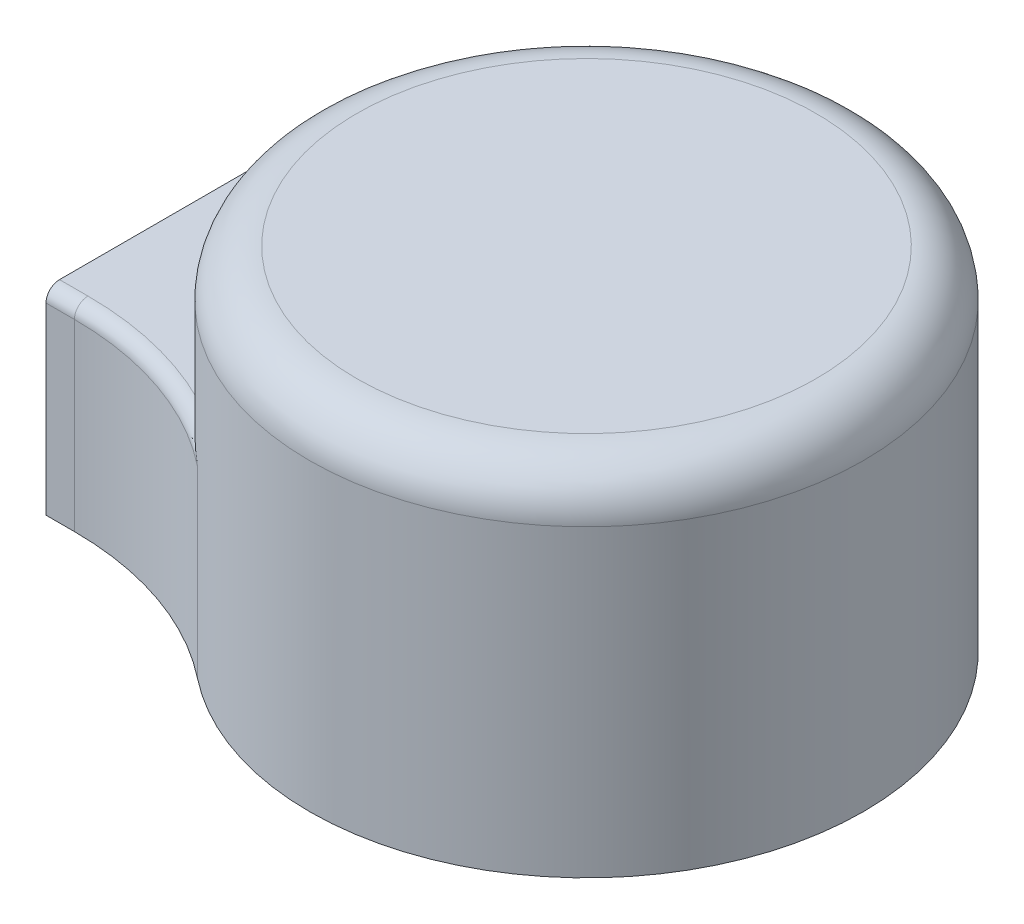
ISO-10303-21;
HEADER;
FILE_DESCRIPTION(('STEP AP214'),'2;1');
FILE_NAME('part.step','',(''),(''),'','','');
FILE_SCHEMA(('AUTOMOTIVE_DESIGN { 1 0 10303 214 1 1 1 1 }'));
ENDSEC;
DATA;
#1=APPLICATION_CONTEXT('core data for automotive mechanical design processes');
#2=APPLICATION_PROTOCOL_DEFINITION('international standard','automotive_design',2000,#1);
#3=PRODUCT_CONTEXT('',#1,'mechanical');
#4=PRODUCT('Part','Part','',(#3));
#5=PRODUCT_RELATED_PRODUCT_CATEGORY('part','',(#4));
#6=PRODUCT_DEFINITION_FORMATION('','',#4);
#7=PRODUCT_DEFINITION_CONTEXT('part definition',#1,'design');
#8=PRODUCT_DEFINITION('design','',#6,#7);
#9=PRODUCT_DEFINITION_SHAPE('','',#8);
#10=(LENGTH_UNIT() NAMED_UNIT(*) SI_UNIT(.MILLI.,.METRE.));
#11=(NAMED_UNIT(*) PLANE_ANGLE_UNIT() SI_UNIT($,.RADIAN.));
#12=(NAMED_UNIT(*) SI_UNIT($,.STERADIAN.) SOLID_ANGLE_UNIT());
#13=UNCERTAINTY_MEASURE_WITH_UNIT(LENGTH_MEASURE(1.E-05),#10,'distance_accuracy_value','');
#14=(GEOMETRIC_REPRESENTATION_CONTEXT(3) GLOBAL_UNCERTAINTY_ASSIGNED_CONTEXT((#13)) GLOBAL_UNIT_ASSIGNED_CONTEXT((#10,
#11,#12)) REPRESENTATION_CONTEXT('',''));
#15=CARTESIAN_POINT('',(0.,0.,0.));
#16=DIRECTION('',(0.,0.,1.));
#17=DIRECTION('',(1.,0.,0.));
#18=AXIS2_PLACEMENT_3D('',#15,#16,#17);
#19=CARTESIAN_POINT('',(0.,45.,0.));
#20=DIRECTION('',(0.,1.,0.));
#21=DIRECTION('',(0.,0.,1.));
#22=AXIS2_PLACEMENT_3D('',#19,#20,#21);
#23=TOROIDAL_SURFACE('',#22,34.,5.);
#24=CARTESIAN_POINT('',(0.,45.,0.));
#25=DIRECTION('',(0.,-1.,0.));
#26=DIRECTION('',(0.,0.,-1.));
#27=AXIS2_PLACEMENT_3D('',#24,#25,#26);
#28=CIRCLE('',#27,39.);
#29=CARTESIAN_POINT('',(38.8426312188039,45.,3.5));
#30=VERTEX_POINT('',#29);
#31=CARTESIAN_POINT('',(38.8426312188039,45.,-3.5));
#32=VERTEX_POINT('',#31);
#33=EDGE_CURVE('E225',#30,#32,#28,.T.);
#34=ORIENTED_EDGE('',*,*,#33,.T.);
#35=CARTESIAN_POINT('',(34.5514701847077,49.946675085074,-3.5));
#36=CARTESIAN_POINT('',(34.6914075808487,49.9261783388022,-3.5));
#37=CARTESIAN_POINT('',(34.8304658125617,49.8997994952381,-3.5));
#38=CARTESIAN_POINT('',(35.1059198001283,49.8354445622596,-3.5));
#39=CARTESIAN_POINT('',(35.2423148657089,49.7974655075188,-3.5));
#40=CARTESIAN_POINT('',(35.5115422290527,49.7101332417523,-3.5));
#41=CARTESIAN_POINT('',(35.6443713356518,49.6607701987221,-3.5));
#42=CARTESIAN_POINT('',(35.9054463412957,49.5510071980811,-3.5));
#43=CARTESIAN_POINT('',(36.033690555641,49.4906032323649,-3.5));
#44=CARTESIAN_POINT('',(36.2845414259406,49.3592324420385,-3.5));
#45=CARTESIAN_POINT('',(36.4071517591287,49.288272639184,-3.5));
#46=CARTESIAN_POINT('',(36.6459885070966,49.1362267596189,-3.5));
#47=CARTESIAN_POINT('',(36.7622125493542,49.0551369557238,-3.5));
#48=CARTESIAN_POINT('',(36.9873186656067,48.8834736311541,-3.5));
#49=CARTESIAN_POINT('',(37.0962052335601,48.7929060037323,-3.5));
#50=CARTESIAN_POINT('',(37.3059653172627,48.6028485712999,-3.5));
#51=CARTESIAN_POINT('',(37.4068358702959,48.5033554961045,-3.5));
#52=CARTESIAN_POINT('',(37.5994529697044,48.2965379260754,-3.5));
#53=CARTESIAN_POINT('',(37.6912297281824,48.1892415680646,-3.5));
#54=CARTESIAN_POINT('',(37.8654189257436,47.9672345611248,-3.5));
#55=CARTESIAN_POINT('',(37.9478278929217,47.852521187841,-3.5));
#56=CARTESIAN_POINT('',(38.1026150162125,47.6165727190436,-3.5));
#57=CARTESIAN_POINT('',(38.1749966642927,47.4953399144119,-3.5));
#58=CARTESIAN_POINT('',(38.3092597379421,47.2471348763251,-3.5));
#59=CARTESIAN_POINT('',(38.371137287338,47.1201605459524,-3.5));
#60=CARTESIAN_POINT('',(38.4836467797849,46.8620181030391,-3.5));
#61=CARTESIAN_POINT('',(38.5343291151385,46.7308719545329,-3.5));
#62=CARTESIAN_POINT('',(38.6244569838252,46.4647220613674,-3.5));
#63=CARTESIAN_POINT('',(38.663898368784,46.3297169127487,-3.5));
#64=CARTESIAN_POINT('',(38.7312169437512,46.0568988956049,-3.5));
#65=CARTESIAN_POINT('',(38.7590986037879,45.9190871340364,-3.5));
#66=CARTESIAN_POINT('',(38.8031304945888,45.6415880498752,-3.5));
#67=CARTESIAN_POINT('',(38.8192763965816,45.5019000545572,-3.5));
#68=CARTESIAN_POINT('',(38.8498021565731,45.0823976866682,-3.5));
#69=CARTESIAN_POINT('',(38.8465307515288,44.8010834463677,-3.5));
#70=CARTESIAN_POINT('',(38.7927677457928,44.243159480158,-3.5));
#71=CARTESIAN_POINT('',(38.74227656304,43.966549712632,-3.5));
#72=CARTESIAN_POINT('',(38.5956160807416,43.4258560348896,-3.5));
#73=CARTESIAN_POINT('',(38.4994739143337,43.1617647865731,-3.5));
#74=CARTESIAN_POINT('',(38.2642898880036,42.6534437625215,-3.5));
#75=CARTESIAN_POINT('',(38.1252477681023,42.4092141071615,-3.5));
#76=CARTESIAN_POINT('',(37.8079887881,41.9470657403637,-3.5));
#77=CARTESIAN_POINT('',(37.6297051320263,41.7291928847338,-3.5));
#78=CARTESIAN_POINT('',(37.2392093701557,41.3263396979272,-3.5));
#79=CARTESIAN_POINT('',(37.0269967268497,41.1413598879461,-3.5));
#80=CARTESIAN_POINT('',(36.5738645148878,40.80881716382,-3.5));
#81=CARTESIAN_POINT('',(36.332844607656,40.6613909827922,-3.5));
#82=CARTESIAN_POINT('',(35.829559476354,40.4088884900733,-3.5));
#83=CARTESIAN_POINT('',(35.5672937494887,40.3038131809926,-3.5));
#84=CARTESIAN_POINT('',(35.0277139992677,40.1385044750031,-3.5));
#85=CARTESIAN_POINT('',(34.750338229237,40.0784726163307,-3.5));
#86=CARTESIAN_POINT('',(34.1894532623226,40.005636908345,-3.5));
#87=CARTESIAN_POINT('',(33.9059439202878,39.9928341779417,-3.5));
#88=CARTESIAN_POINT('',(33.3397093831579,40.0148124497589,-3.5));
#89=CARTESIAN_POINT('',(33.0569910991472,40.0497718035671,-3.5));
#90=CARTESIAN_POINT('',(32.501413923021,40.166594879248,-3.5));
#91=CARTESIAN_POINT('',(32.2285551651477,40.2484592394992,-3.5));
#92=CARTESIAN_POINT('',(31.7001150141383,40.4569419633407,-3.5));
#93=CARTESIAN_POINT('',(31.4445551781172,40.5836149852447,-3.5));
#94=CARTESIAN_POINT('',(30.9583995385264,40.8781725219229,-3.5));
#95=CARTESIAN_POINT('',(30.7278035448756,41.0460567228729,-3.5));
#96=CARTESIAN_POINT('',(30.2988056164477,41.4178610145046,-3.5));
#97=CARTESIAN_POINT('',(30.1003222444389,41.6216871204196,-3.5));
#98=CARTESIAN_POINT('',(29.7406375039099,42.0599427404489,-3.5));
#99=CARTESIAN_POINT('',(29.5794349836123,42.294371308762,-3.5));
#100=CARTESIAN_POINT('',(29.2999262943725,42.7857022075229,-3.5));
#101=CARTESIAN_POINT('',(29.1813721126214,43.0424634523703,-3.5));
#102=CARTESIAN_POINT('',(28.9893741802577,43.5723410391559,-3.5));
#103=CARTESIAN_POINT('',(28.9159285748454,43.8454567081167,-3.5));
#104=CARTESIAN_POINT('',(28.8166654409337,44.3983631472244,-3.5));
#105=CARTESIAN_POINT('',(28.7905460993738,44.6781000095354,-3.5));
#106=CARTESIAN_POINT('',(28.7858441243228,45.2381203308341,-3.5));
#107=CARTESIAN_POINT('',(28.807260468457,45.5184037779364,-3.5));
#108=CARTESIAN_POINT('',(28.8743700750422,45.9324419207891,-3.5));
#109=CARTESIAN_POINT('',(28.902526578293,46.0692605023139,-3.5));
#110=CARTESIAN_POINT('',(28.9702413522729,46.3400321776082,-3.5));
#111=CARTESIAN_POINT('',(29.0097954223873,46.4739863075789,-3.5));
#112=CARTESIAN_POINT('',(29.1000351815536,46.7381355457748,-3.5));
#113=CARTESIAN_POINT('',(29.1507249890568,46.868329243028,-3.5));
#114=CARTESIAN_POINT('',(29.262833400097,47.1239583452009,-3.5));
#115=CARTESIAN_POINT('',(29.3242481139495,47.2493954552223,-3.5));
#116=CARTESIAN_POINT('',(29.457553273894,47.4950197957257,-3.5));
#117=CARTESIAN_POINT('',(29.5294720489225,47.6151916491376,-3.5));
#118=CARTESIAN_POINT('',(29.6831063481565,47.8490378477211,-3.5));
#119=CARTESIAN_POINT('',(29.7648183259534,47.9627145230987,-3.5));
#120=CARTESIAN_POINT('',(29.9374988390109,48.1828682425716,-3.5));
#121=CARTESIAN_POINT('',(30.0284705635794,48.2893427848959,-3.5));
#122=CARTESIAN_POINT('',(30.2189595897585,48.4942790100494,-3.5));
#123=CARTESIAN_POINT('',(30.3184738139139,48.5927435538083,-3.5));
#124=CARTESIAN_POINT('',(30.5260307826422,48.781631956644,-3.5));
#125=CARTESIAN_POINT('',(30.6341240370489,48.8720003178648,-3.5));
#126=CARTESIAN_POINT('',(30.8574636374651,49.0433280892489,-3.5));
#127=CARTESIAN_POINT('',(30.9727074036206,49.1242908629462,-3.5));
#128=CARTESIAN_POINT('',(31.2096404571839,49.2763381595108,-3.5));
#129=CARTESIAN_POINT('',(31.33133380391,49.3474163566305,-3.5));
#130=CARTESIAN_POINT('',(31.5801929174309,49.4791224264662,-3.5));
#131=CARTESIAN_POINT('',(31.7073566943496,49.5397540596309,-3.5));
#132=CARTESIAN_POINT('',(31.9672144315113,49.6505719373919,-3.5));
#133=CARTESIAN_POINT('',(32.099940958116,49.7006818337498,-3.5));
#134=CARTESIAN_POINT('',(32.3690870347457,49.7895515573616,-3.5));
#135=CARTESIAN_POINT('',(32.5055052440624,49.8283154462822,-3.5));
#136=CARTESIAN_POINT('',(32.7809988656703,49.8942191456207,-3.5));
#137=CARTESIAN_POINT('',(32.9200718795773,49.9213689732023,-3.5));
#138=CARTESIAN_POINT('',(33.1999600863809,49.9638980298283,-3.5));
#139=CARTESIAN_POINT('',(33.3407748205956,49.9792802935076,-3.5));
#140=CARTESIAN_POINT('',(33.6603041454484,50.0006540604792,-3.5));
#141=CARTESIAN_POINT('',(33.8392649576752,50.0031208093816,-3.5));
#142=CARTESIAN_POINT('',(34.1964417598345,49.9890802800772,-3.5));
#143=CARTESIAN_POINT('',(34.3746577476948,49.9725729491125,-3.5));
#144=CARTESIAN_POINT('',(34.5514701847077,49.946675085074,-3.5));
#145=B_SPLINE_CURVE_WITH_KNOTS('',3,(#35,#36,#37,#38,#39,#40,#41,#42,#43,#44,#45,#46,#47,#48,
#49,#50,#51,#52,#53,#54,#55,#56,#57,#58,#59,#60,#61,#62,#63,#64,#65,#66,#67,#68,#69,#70,#71,#72,
#73,#74,#75,#76,#77,#78,#79,#80,#81,#82,#83,#84,#85,#86,#87,#88,#89,#90,#91,#92,#93,#94,#95,#96,
#97,#98,#99,#100,#101,#102,#103,#104,#105,#106,#107,#108,#109,#110,#111,#112,#113,#114,#115,
#116,#117,#118,#119,#120,#121,#122,#123,#124,#125,#126,#127,#128,#129,#130,#131,#132,#133,#134,
#135,#136,#137,#138,#139,#140,#141,#142,#143,#144),.UNSPECIFIED.,.T.,.F.,(4,2,2,2,2,2,2,2,2,2,2,
2,2,2,2,2,2,2,2,2,2,2,2,2,2,2,2,2,2,2,2,2,2,2,2,2,2,2,2,2,2,2,2,2,2,2,2,2,2,2,2,2,2,2,4),(0.,
0.424136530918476,0.8483815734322,1.27299440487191,1.69776168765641,2.12224766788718,
2.54689029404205,2.97127043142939,3.39580669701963,3.81888159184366,4.24211277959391,
4.6651962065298,5.08843541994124,5.5097288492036,5.93117755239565,6.35246313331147,
6.77390402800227,7.61354826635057,8.45318507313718,9.2923234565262,10.1314669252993,
10.9720499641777,11.8126463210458,12.6562609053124,13.4998954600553,14.3472825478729,
15.194689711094,16.0452698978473,16.8958616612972,17.7474945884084,18.5991210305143,
19.4485527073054,20.2979581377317,21.142340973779,21.9866890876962,22.8256333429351,
23.6645595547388,24.0832112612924,24.5017088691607,24.9203615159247,25.3388626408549,
25.7585140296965,26.1780139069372,26.5976587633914,27.0171530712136,27.4393323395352,
27.8613601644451,28.283656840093,28.7058011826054,29.1309102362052,29.5558669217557,
29.9804563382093,30.404936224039,30.9408358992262,31.4767370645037),.UNSPECIFIED.);
#146=CARTESIAN_POINT('',(33.8426312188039,49.9999464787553,-3.5));
#147=VERTEX_POINT('',#146);
#148=EDGE_CURVE('E470',#147,#32,#145,.T.);
#149=ORIENTED_EDGE('',*,*,#148,.F.);
#150=CARTESIAN_POINT('',(33.8426312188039,49.9999381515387,-2.99763574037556));
#151=CARTESIAN_POINT('',(33.8426312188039,50.0001233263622,-3.41530156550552));
#152=CARTESIAN_POINT('',(33.8426312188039,49.9999526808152,-3.83296782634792));
#153=CARTESIAN_POINT('',(33.8426312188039,49.997691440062,-4.66830133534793));
#154=CARTESIAN_POINT('',(33.8426312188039,49.9956008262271,-5.08596858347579));
#155=CARTESIAN_POINT('',(33.8426312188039,49.9878838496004,-5.92154375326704));
#156=CARTESIAN_POINT('',(33.8426312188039,49.9822552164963,-6.33945165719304));
#157=CARTESIAN_POINT('',(33.8426312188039,49.9654557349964,-7.175156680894));
#158=CARTESIAN_POINT('',(33.8426312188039,49.95428500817,-7.5929538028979));
#159=CARTESIAN_POINT('',(33.8426312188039,49.9239817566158,-8.42842877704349));
#160=CARTESIAN_POINT('',(33.8426312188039,49.9048463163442,-8.84610652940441));
#161=CARTESIAN_POINT('',(33.8426312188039,49.8557345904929,-9.68089862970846));
#162=CARTESIAN_POINT('',(33.8426312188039,49.8257571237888,-10.0980129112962));
#163=CARTESIAN_POINT('',(33.8426312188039,49.7515697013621,-10.9304740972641));
#164=CARTESIAN_POINT('',(33.8426312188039,49.7073780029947,-11.34582258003));
#165=CARTESIAN_POINT('',(33.8426312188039,49.6006180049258,-12.1741075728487));
#166=CARTESIAN_POINT('',(33.8426312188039,49.5380555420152,-12.5870448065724));
#167=CARTESIAN_POINT('',(33.8426312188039,49.4067417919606,-13.3126819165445));
#168=CARTESIAN_POINT('',(33.8426312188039,49.3428543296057,-13.6262528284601));
#169=CARTESIAN_POINT('',(33.8426312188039,49.1982872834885,-14.2497318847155));
#170=CARTESIAN_POINT('',(33.8426312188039,49.1175996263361,-14.5596381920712));
#171=CARTESIAN_POINT('',(33.8426312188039,48.936301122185,-15.1720512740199));
#172=CARTESIAN_POINT('',(33.8426312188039,48.8357868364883,-15.4745862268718));
#173=CARTESIAN_POINT('',(33.8426312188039,48.6102191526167,-16.0702421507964));
#174=CARTESIAN_POINT('',(33.8426312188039,48.4851920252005,-16.3633728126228));
#175=CARTESIAN_POINT('',(33.8426312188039,48.2352680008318,-16.872958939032));
#176=CARTESIAN_POINT('',(33.8426312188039,48.1162176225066,-17.0922614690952));
#177=CARTESIAN_POINT('',(33.8426312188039,47.8558546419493,-17.5181112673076));
#178=CARTESIAN_POINT('',(33.8426312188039,47.7145044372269,-17.7246361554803));
#179=CARTESIAN_POINT('',(33.8426312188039,47.4822644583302,-18.020447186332));
#180=CARTESIAN_POINT('',(33.8426312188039,47.4009423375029,-18.1172492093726));
#181=CARTESIAN_POINT('',(33.8426312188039,47.231249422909,-18.3044415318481));
#182=CARTESIAN_POINT('',(33.8426312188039,47.1428773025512,-18.3948306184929));
#183=CARTESIAN_POINT('',(33.8426312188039,46.8669548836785,-18.653680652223));
#184=CARTESIAN_POINT('',(33.8426312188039,46.6679417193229,-18.8106960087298));
#185=CARTESIAN_POINT('',(33.8426312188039,46.3216707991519,-19.02617788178));
#186=CARTESIAN_POINT('',(33.8426312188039,46.1835686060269,-19.099402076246));
#187=CARTESIAN_POINT('',(33.8426312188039,45.897383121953,-19.2229486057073));
#188=CARTESIAN_POINT('',(33.8426312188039,45.7493088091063,-19.2732912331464));
#189=CARTESIAN_POINT('',(33.8426312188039,45.4452923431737,-19.3471596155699));
#190=CARTESIAN_POINT('',(33.8426312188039,45.2892991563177,-19.3704796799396));
#191=CARTESIAN_POINT('',(33.8426312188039,44.9757127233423,-19.3871951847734));
#192=CARTESIAN_POINT('',(33.8426312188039,44.8181200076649,-19.38060024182));
#193=CARTESIAN_POINT('',(33.8426312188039,44.522422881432,-19.3403461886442));
#194=CARTESIAN_POINT('',(33.8426312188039,44.3839312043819,-19.309425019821));
#195=CARTESIAN_POINT('',(33.8426312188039,44.1135203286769,-19.2263755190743));
#196=CARTESIAN_POINT('',(33.8426312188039,43.9816039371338,-19.1742382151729));
#197=CARTESIAN_POINT('',(33.8426312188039,43.677007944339,-19.0283851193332));
#198=CARTESIAN_POINT('',(33.8426312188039,43.5083108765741,-18.926386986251));
#199=CARTESIAN_POINT('',(33.8426312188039,43.189326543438,-18.6967621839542));
#200=CARTESIAN_POINT('',(33.8426312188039,43.0390833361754,-18.5690760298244));
#201=CARTESIAN_POINT('',(33.8426312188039,42.7870178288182,-18.324873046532));
#202=CARTESIAN_POINT('',(33.8426312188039,42.6817300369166,-18.2118571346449));
#203=CARTESIAN_POINT('',(33.8426312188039,42.4813768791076,-17.9770334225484));
#204=CARTESIAN_POINT('',(33.8426312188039,42.3863177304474,-17.8552203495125));
#205=CARTESIAN_POINT('',(33.8426312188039,42.2054999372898,-17.6047079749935));
#206=CARTESIAN_POINT('',(33.8426312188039,42.1197526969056,-17.4760005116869));
#207=CARTESIAN_POINT('',(33.8426312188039,41.9567725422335,-17.2132780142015));
#208=CARTESIAN_POINT('',(33.8426312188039,41.8795429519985,-17.0792609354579));
#209=CARTESIAN_POINT('',(33.8426312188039,41.665873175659,-16.6830455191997));
#210=CARTESIAN_POINT('',(33.8426312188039,41.5396157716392,-16.4153391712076));
#211=CARTESIAN_POINT('',(33.8426312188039,41.3101410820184,-15.8701793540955));
#212=CARTESIAN_POINT('',(33.8426312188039,41.2069470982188,-15.5927163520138));
#213=CARTESIAN_POINT('',(33.8426312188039,41.0194892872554,-15.0307911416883));
#214=CARTESIAN_POINT('',(33.8426312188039,40.9352711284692,-14.7463138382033));
#215=CARTESIAN_POINT('',(33.8426312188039,40.8210134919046,-14.3165703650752));
#216=CARTESIAN_POINT('',(33.8426312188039,40.78494768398,-14.1728589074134));
#217=CARTESIAN_POINT('',(33.8426312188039,40.7164874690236,-13.8845633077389));
#218=CARTESIAN_POINT('',(33.8426312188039,40.6840930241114,-13.7399791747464));
#219=CARTESIAN_POINT('',(33.8426312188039,40.5939157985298,-13.3144836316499));
#220=CARTESIAN_POINT('',(33.8426312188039,40.5407377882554,-13.0325922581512));
#221=CARTESIAN_POINT('',(33.8426312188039,40.4449738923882,-12.4669960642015));
#222=CARTESIAN_POINT('',(33.8426312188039,40.4023900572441,-12.1832909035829));
#223=CARTESIAN_POINT('',(33.8426312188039,40.3261428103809,-11.6145055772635));
#224=CARTESIAN_POINT('',(33.8426312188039,40.2924853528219,-11.329424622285));
#225=CARTESIAN_POINT('',(33.8426312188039,40.2326980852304,-10.7584648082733));
#226=CARTESIAN_POINT('',(33.8426312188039,40.2065688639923,-10.4725858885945));
#227=CARTESIAN_POINT('',(33.8426312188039,40.1605269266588,-9.89945420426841));
#228=CARTESIAN_POINT('',(33.8426312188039,40.1406335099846,-9.61219991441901));
#229=CARTESIAN_POINT('',(33.8426312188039,40.1060755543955,-9.03737283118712));
#230=CARTESIAN_POINT('',(33.8426312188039,40.0914112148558,-8.74980002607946));
#231=CARTESIAN_POINT('',(33.8426312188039,40.0537788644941,-7.8870335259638));
#232=CARTESIAN_POINT('',(33.8426312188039,40.0371551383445,-7.31156774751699));
#233=CARTESIAN_POINT('',(33.8426312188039,40.0142265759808,-6.15763277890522));
#234=CARTESIAN_POINT('',(33.8426312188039,40.0079731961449,-5.57916281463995));
#235=CARTESIAN_POINT('',(33.8426312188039,40.0008583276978,-4.42216127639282));
#236=CARTESIAN_POINT('',(33.8426312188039,39.999997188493,-3.84362970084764));
#237=CARTESIAN_POINT('',(33.8426312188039,40.000002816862,-2.68758670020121));
#238=CARTESIAN_POINT('',(33.8426312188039,40.0008665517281,-2.11007526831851));
#239=CARTESIAN_POINT('',(33.8426312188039,40.0021442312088,-0.955066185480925));
#240=CARTESIAN_POINT('',(33.8426312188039,40.0025581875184,-0.377568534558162));
#241=CARTESIAN_POINT('',(33.8426312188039,40.0023847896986,0.627401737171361));
#242=CARTESIAN_POINT('',(33.8426312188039,40.002029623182,1.05487442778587));
#243=CARTESIAN_POINT('',(33.8426312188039,40.0010918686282,1.90981959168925));
#244=CARTESIAN_POINT('',(33.8426312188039,40.0005092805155,2.33729206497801));
#245=CARTESIAN_POINT('',(33.8426312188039,39.9998887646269,3.19252580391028));
#246=CARTESIAN_POINT('',(33.8426312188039,39.9998512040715,3.62028707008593));
#247=CARTESIAN_POINT('',(33.8426312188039,40.0015558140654,4.47580497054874));
#248=CARTESIAN_POINT('',(33.8426312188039,40.0032979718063,4.90356160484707));
#249=CARTESIAN_POINT('',(33.8426312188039,40.0102240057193,5.75836911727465));
#250=CARTESIAN_POINT('',(33.8426312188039,40.0154023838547,6.18542003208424));
#251=CARTESIAN_POINT('',(33.8426312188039,40.0312822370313,7.03944487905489));
#252=CARTESIAN_POINT('',(33.8426312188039,40.0419839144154,7.4664188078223));
#253=CARTESIAN_POINT('',(33.8426312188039,40.071430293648,8.31985027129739));
#254=CARTESIAN_POINT('',(33.8426312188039,40.090170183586,8.74630796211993));
#255=CARTESIAN_POINT('',(33.8426312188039,40.138706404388,9.59858092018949));
#256=CARTESIAN_POINT('',(33.8426312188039,40.1685015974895,10.0243962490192));
#257=CARTESIAN_POINT('',(33.8426312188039,40.2430840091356,10.8784458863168));
#258=CARTESIAN_POINT('',(33.8426312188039,40.2879982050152,11.3066694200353));
#259=CARTESIAN_POINT('',(33.8426312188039,40.3972873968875,12.1609466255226));
#260=CARTESIAN_POINT('',(33.8426312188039,40.461671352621,12.5869992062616));
#261=CARTESIAN_POINT('',(33.8426312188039,40.5770875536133,13.2225596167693));
#262=CARTESIAN_POINT('',(33.8426312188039,40.6186899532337,13.4337867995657));
#263=CARTESIAN_POINT('',(33.8426312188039,40.7090505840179,13.85469623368));
#264=CARTESIAN_POINT('',(33.8426312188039,40.757808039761,14.0643786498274));
#265=CARTESIAN_POINT('',(33.8426312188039,40.8634117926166,14.4815057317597));
#266=CARTESIAN_POINT('',(33.8426312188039,40.920250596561,14.6889522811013));
#267=CARTESIAN_POINT('',(33.8426312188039,41.0432003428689,15.1011327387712));
#268=CARTESIAN_POINT('',(33.8426312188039,41.1093125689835,15.3058662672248));
#269=CARTESIAN_POINT('',(33.8426312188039,41.2526853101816,15.7131908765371));
#270=CARTESIAN_POINT('',(33.8426312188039,41.3300274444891,15.9157534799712));
#271=CARTESIAN_POINT('',(33.8426312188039,41.4970519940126,16.3156790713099));
#272=CARTESIAN_POINT('',(33.8426312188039,41.5867293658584,16.5130441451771));
#273=CARTESIAN_POINT('',(33.8426312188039,41.7800069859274,16.9000397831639));
#274=CARTESIAN_POINT('',(33.8426312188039,41.883556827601,17.0896952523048));
#275=CARTESIAN_POINT('',(33.8426312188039,42.1069111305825,17.4590716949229));
#276=CARTESIAN_POINT('',(33.8426312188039,42.2267003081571,17.6388017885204));
#277=CARTESIAN_POINT('',(33.8426312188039,42.4797137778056,17.9772780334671));
#278=CARTESIAN_POINT('',(33.8426312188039,42.6121767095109,18.1365848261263));
#279=CARTESIAN_POINT('',(33.8426312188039,42.8965805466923,18.4373435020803));
#280=CARTESIAN_POINT('',(33.8426312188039,43.0485417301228,18.5787764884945));
#281=CARTESIAN_POINT('',(33.8426312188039,43.3758613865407,18.8379465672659));
#282=CARTESIAN_POINT('',(33.8426312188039,43.5515302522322,18.9553058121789));
#283=CARTESIAN_POINT('',(33.8426312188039,43.8295848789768,19.1032789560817));
#284=CARTESIAN_POINT('',(33.8426312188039,43.9245973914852,19.1478964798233));
#285=CARTESIAN_POINT('',(33.8426312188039,44.1188966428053,19.226489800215));
#286=CARTESIAN_POINT('',(33.8426312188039,44.2181807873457,19.2604719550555));
#287=CARTESIAN_POINT('',(33.8426312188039,44.456289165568,19.3265432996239));
#288=CARTESIAN_POINT('',(33.8426312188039,44.5965575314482,19.3536106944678));
#289=CARTESIAN_POINT('',(33.8426312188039,44.8796072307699,19.3834983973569));
#290=CARTESIAN_POINT('',(33.8426312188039,45.0223873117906,19.3863304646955));
#291=CARTESIAN_POINT('',(33.8426312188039,45.3062332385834,19.3675431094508));
#292=CARTESIAN_POINT('',(33.8426312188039,45.4472999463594,19.345936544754));
#293=CARTESIAN_POINT('',(33.8426312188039,45.7240235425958,19.2801095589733));
#294=CARTESIAN_POINT('',(33.8426312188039,45.8596769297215,19.235874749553));
#295=CARTESIAN_POINT('',(33.8426312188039,46.1624151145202,19.11168076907));
#296=CARTESIAN_POINT('',(33.8426312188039,46.3267216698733,19.0249856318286));
#297=CARTESIAN_POINT('',(33.8426312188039,46.6392186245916,18.8262154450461));
#298=CARTESIAN_POINT('',(33.8426312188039,46.7873750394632,18.7140883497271));
#299=CARTESIAN_POINT('',(33.8426312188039,47.0336112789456,18.5004571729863));
#300=CARTESIAN_POINT('',(33.8426312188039,47.1351702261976,18.4028732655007));
#301=CARTESIAN_POINT('',(33.8426312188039,47.3293894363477,18.1991564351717));
#302=CARTESIAN_POINT('',(33.8426312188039,47.4220448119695,18.0930188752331));
#303=CARTESIAN_POINT('',(33.8426312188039,47.5991179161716,17.8739289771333));
#304=CARTESIAN_POINT('',(33.8426312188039,47.6835259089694,17.7609688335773));
#305=CARTESIAN_POINT('',(33.8426312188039,47.8446953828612,17.5296962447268));
#306=CARTESIAN_POINT('',(33.8426312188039,47.9214539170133,17.4113817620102));
#307=CARTESIAN_POINT('',(33.8426312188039,48.1297732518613,17.0689486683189));
#308=CARTESIAN_POINT('',(33.8426312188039,48.2529744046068,16.8397292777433));
#309=CARTESIAN_POINT('',(33.8426312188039,48.4794518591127,16.3716109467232));
#310=CARTESIAN_POINT('',(33.8426312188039,48.5827092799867,16.1327030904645));
#311=CARTESIAN_POINT('',(33.8426312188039,48.7725679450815,15.6477600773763));
#312=CARTESIAN_POINT('',(33.8426312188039,48.8591294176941,15.4017094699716));
#313=CARTESIAN_POINT('',(33.8426312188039,48.978140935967,15.0293376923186));
#314=CARTESIAN_POINT('',(33.8426312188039,49.0159969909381,14.9047007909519));
#315=CARTESIAN_POINT('',(33.8426312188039,49.0883884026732,14.6544666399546));
#316=CARTESIAN_POINT('',(33.8426312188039,49.1229238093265,14.5288694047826));
#317=CARTESIAN_POINT('',(33.8426312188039,49.2285578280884,14.125617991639));
#318=CARTESIAN_POINT('',(33.8426312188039,49.2937826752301,13.8464155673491));
#319=CARTESIAN_POINT('',(33.8426312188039,49.4117750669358,13.2853624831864));
#320=CARTESIAN_POINT('',(33.8426312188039,49.4645390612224,13.003511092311));
#321=CARTESIAN_POINT('',(33.8426312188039,49.5595850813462,12.4377580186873));
#322=CARTESIAN_POINT('',(33.8426312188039,49.6018559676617,12.1538544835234));
#323=CARTESIAN_POINT('',(33.8426312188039,49.6774920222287,11.5849074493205));
#324=CARTESIAN_POINT('',(33.8426312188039,49.710857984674,11.2998640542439));
#325=CARTESIAN_POINT('',(33.8426312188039,49.7702370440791,10.7277979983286));
#326=CARTESIAN_POINT('',(33.8426312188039,49.7962182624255,10.4407720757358));
#327=CARTESIAN_POINT('',(33.8426312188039,49.8418839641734,9.8662139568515));
#328=CARTESIAN_POINT('',(33.8426312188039,49.8615681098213,9.5786817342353));
#329=CARTESIAN_POINT('',(33.8426312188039,49.9128392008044,8.71595394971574));
#330=CARTESIAN_POINT('',(33.8426312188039,49.9366758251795,8.14030272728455));
#331=CARTESIAN_POINT('',(33.8426312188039,49.9711440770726,6.98498011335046));
#332=CARTESIAN_POINT('',(33.8426312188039,49.9816899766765,6.40530663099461));
#333=CARTESIAN_POINT('',(33.8426312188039,49.9951129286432,5.24582967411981));
#334=CARTESIAN_POINT('',(33.8426312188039,49.9979892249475,4.66602619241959));
#335=CARTESIAN_POINT('',(33.8426312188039,50.000444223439,3.50761656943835));
#336=CARTESIAN_POINT('',(33.8426312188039,50.0000297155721,2.92901042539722));
#337=CARTESIAN_POINT('',(33.8426312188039,49.9988196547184,1.7718179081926));
#338=CARTESIAN_POINT('',(33.8426312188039,49.9980241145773,1.19323153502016));
#339=CARTESIAN_POINT('',(33.8426312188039,49.9975244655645,0.313457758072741));
#340=CARTESIAN_POINT('',(33.8426312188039,49.997479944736,0.0122706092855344));
#341=CARTESIAN_POINT('',(33.8426312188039,49.9976432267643,-0.590188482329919));
#342=CARTESIAN_POINT('',(33.8426312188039,49.9978511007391,-0.891460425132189));
#343=CARTESIAN_POINT('',(33.8426312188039,49.9984291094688,-1.49354953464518));
#344=CARTESIAN_POINT('',(33.8426312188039,49.9987989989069,-1.79436670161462));
#345=CARTESIAN_POINT('',(33.8426312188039,49.9994868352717,-2.396001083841));
#346=CARTESIAN_POINT('',(33.8426312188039,49.9998047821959,-2.69681829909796));
#347=CARTESIAN_POINT('',(33.8426312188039,49.9999381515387,-2.99763574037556));
#348=B_SPLINE_CURVE_WITH_KNOTS('',3,(#150,#151,#152,#153,#154,#155,#156,#157,#158,#159,#160,
#161,#162,#163,#164,#165,#166,#167,#168,#169,#170,#171,#172,#173,#174,#175,#176,#177,#178,#179,
#180,#181,#182,#183,#184,#185,#186,#187,#188,#189,#190,#191,#192,#193,#194,#195,#196,#197,#198,
#199,#200,#201,#202,#203,#204,#205,#206,#207,#208,#209,#210,#211,#212,#213,#214,#215,#216,#217,
#218,#219,#220,#221,#222,#223,#224,#225,#226,#227,#228,#229,#230,#231,#232,#233,#234,#235,#236,
#237,#238,#239,#240,#241,#242,#243,#244,#245,#246,#247,#248,#249,#250,#251,#252,#253,#254,#255,
#256,#257,#258,#259,#260,#261,#262,#263,#264,#265,#266,#267,#268,#269,#270,#271,#272,#273,#274,
#275,#276,#277,#278,#279,#280,#281,#282,#283,#284,#285,#286,#287,#288,#289,#290,#291,#292,#293,
#294,#295,#296,#297,#298,#299,#300,#301,#302,#303,#304,#305,#306,#307,#308,#309,#310,#311,#312,
#313,#314,#315,#316,#317,#318,#319,#320,#321,#322,#323,#324,#325,#326,#327,#328,#329,#330,#331,
#332,#333,#334,#335,#336,#337,#338,#339,#340,#341,#342,#343,#344,#345,#346,#347),.UNSPECIFIED.,
.T.,.F.,(4,2,2,2,2,2,2,2,2,2,2,2,2,2,2,2,2,2,2,2,2,2,2,2,2,2,2,2,2,2,2,2,2,2,2,2,2,2,2,2,2,2,2,
2,2,2,2,2,2,2,2,2,2,2,2,2,2,2,2,2,2,2,2,2,2,2,2,2,2,2,2,2,2,2,2,2,2,2,2,2,2,2,2,2,2,2,2,2,2,2,2,
2,2,2,2,2,2,2,4),(0.,1.25299731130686,2.50600678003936,3.75982111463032,5.01360794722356,
6.26785414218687,7.52223701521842,8.77501509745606,10.0273955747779,10.9870733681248,
11.9472134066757,12.9027878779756,13.857343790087,14.6049837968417,15.3538982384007,
15.7328441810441,16.1118615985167,16.8666554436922,17.3339830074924,17.8008953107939,
18.2713387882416,18.7416310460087,19.1654646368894,19.5894776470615,20.1775899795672,
20.7670801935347,21.2298296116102,21.6928587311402,22.1564486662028,22.62021888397,
23.5066497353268,24.3939721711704,25.283407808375,25.7278750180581,26.1723376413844,
27.0326610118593,27.8931507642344,28.7542130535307,29.6153426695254,30.4791116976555,
31.3429136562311,33.0698440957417,34.8053179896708,36.5409043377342,38.2734418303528,
40.0059342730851,41.2883525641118,42.5707712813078,43.854054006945,45.137327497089,
46.4185526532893,47.6998247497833,48.9803309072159,50.2607053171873,51.5521130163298,
52.8441159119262,53.489871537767,54.1355572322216,54.7806480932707,55.4258283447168,
56.0759572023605,56.7258210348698,57.3733845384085,58.0203427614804,58.6405215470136,
59.2613506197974,59.8912825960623,60.2056491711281,60.5198274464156,60.9463475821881,
61.372660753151,61.7987497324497,62.2251099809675,62.779368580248,63.3347718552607,
63.7567347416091,64.1789279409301,64.6016136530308,65.0244615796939,65.8038246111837,
66.5839218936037,67.3658551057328,67.7565969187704,68.1473328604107,69.0071089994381,
69.8671298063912,70.7280597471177,71.5889128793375,72.4534275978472,73.3179886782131,
75.0461334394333,76.7853689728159,78.5247759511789,80.2605949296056,81.996355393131,
82.8999167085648,83.8037326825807,84.7061848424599,85.6086370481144),.UNSPECIFIED.);
#349=CARTESIAN_POINT('',(33.8426312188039,50.,-3.26746265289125));
#350=VERTEX_POINT('',#349);
#351=EDGE_CURVE('E476',#350,#147,#348,.T.);
#352=ORIENTED_EDGE('',*,*,#351,.F.);
#353=CARTESIAN_POINT('',(0.,50.,0.));
#354=DIRECTION('',(0.,1.,0.));
#355=DIRECTION('',(0.,0.,1.));
#356=AXIS2_PLACEMENT_3D('',#353,#354,#355);
#357=CIRCLE('',#356,34.);
#358=CARTESIAN_POINT('',(33.8426312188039,50.,3.26746265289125));
#359=VERTEX_POINT('',#358);
#360=EDGE_CURVE('E223',#350,#359,#357,.T.);
#361=ORIENTED_EDGE('',*,*,#360,.T.);
#362=CARTESIAN_POINT('',(33.8426312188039,49.9999381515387,2.99763574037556));
#363=CARTESIAN_POINT('',(33.8426312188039,50.0001233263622,3.41530156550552));
#364=CARTESIAN_POINT('',(33.8426312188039,49.9999526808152,3.83296782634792));
#365=CARTESIAN_POINT('',(33.8426312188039,49.997691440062,4.66830133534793));
#366=CARTESIAN_POINT('',(33.8426312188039,49.9956008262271,5.08596858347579));
#367=CARTESIAN_POINT('',(33.8426312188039,49.9878838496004,5.92154375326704));
#368=CARTESIAN_POINT('',(33.8426312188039,49.9822552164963,6.33945165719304));
#369=CARTESIAN_POINT('',(33.8426312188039,49.9654557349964,7.175156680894));
#370=CARTESIAN_POINT('',(33.8426312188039,49.95428500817,7.5929538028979));
#371=CARTESIAN_POINT('',(33.8426312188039,49.9239817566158,8.42842877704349));
#372=CARTESIAN_POINT('',(33.8426312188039,49.9048463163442,8.84610652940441));
#373=CARTESIAN_POINT('',(33.8426312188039,49.8557345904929,9.68089862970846));
#374=CARTESIAN_POINT('',(33.8426312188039,49.8257571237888,10.0980129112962));
#375=CARTESIAN_POINT('',(33.8426312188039,49.7515697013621,10.9304740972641));
#376=CARTESIAN_POINT('',(33.8426312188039,49.7073780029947,11.34582258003));
#377=CARTESIAN_POINT('',(33.8426312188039,49.6006180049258,12.1741075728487));
#378=CARTESIAN_POINT('',(33.8426312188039,49.5380555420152,12.5870448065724));
#379=CARTESIAN_POINT('',(33.8426312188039,49.4067417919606,13.3126819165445));
#380=CARTESIAN_POINT('',(33.8426312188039,49.3428543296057,13.6262528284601));
#381=CARTESIAN_POINT('',(33.8426312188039,49.1982872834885,14.2497318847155));
#382=CARTESIAN_POINT('',(33.8426312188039,49.1175996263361,14.5596381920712));
#383=CARTESIAN_POINT('',(33.8426312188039,48.936301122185,15.1720512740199));
#384=CARTESIAN_POINT('',(33.8426312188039,48.8357868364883,15.4745862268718));
#385=CARTESIAN_POINT('',(33.8426312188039,48.6102191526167,16.0702421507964));
#386=CARTESIAN_POINT('',(33.8426312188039,48.4851920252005,16.3633728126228));
#387=CARTESIAN_POINT('',(33.8426312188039,48.2352680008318,16.872958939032));
#388=CARTESIAN_POINT('',(33.8426312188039,48.1162176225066,17.0922614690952));
#389=CARTESIAN_POINT('',(33.8426312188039,47.8558546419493,17.5181112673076));
#390=CARTESIAN_POINT('',(33.8426312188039,47.7145044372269,17.7246361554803));
#391=CARTESIAN_POINT('',(33.8426312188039,47.4822644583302,18.020447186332));
#392=CARTESIAN_POINT('',(33.8426312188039,47.4009423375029,18.1172492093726));
#393=CARTESIAN_POINT('',(33.8426312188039,47.231249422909,18.3044415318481));
#394=CARTESIAN_POINT('',(33.8426312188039,47.1428773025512,18.3948306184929));
#395=CARTESIAN_POINT('',(33.8426312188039,46.8669548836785,18.653680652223));
#396=CARTESIAN_POINT('',(33.8426312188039,46.6679417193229,18.8106960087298));
#397=CARTESIAN_POINT('',(33.8426312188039,46.3216707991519,19.02617788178));
#398=CARTESIAN_POINT('',(33.8426312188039,46.1835686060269,19.099402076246));
#399=CARTESIAN_POINT('',(33.8426312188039,45.897383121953,19.2229486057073));
#400=CARTESIAN_POINT('',(33.8426312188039,45.7493088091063,19.2732912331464));
#401=CARTESIAN_POINT('',(33.8426312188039,45.4452923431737,19.3471596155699));
#402=CARTESIAN_POINT('',(33.8426312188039,45.2892991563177,19.3704796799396));
#403=CARTESIAN_POINT('',(33.8426312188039,44.9757127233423,19.3871951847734));
#404=CARTESIAN_POINT('',(33.8426312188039,44.8181200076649,19.38060024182));
#405=CARTESIAN_POINT('',(33.8426312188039,44.522422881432,19.3403461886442));
#406=CARTESIAN_POINT('',(33.8426312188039,44.3839312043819,19.309425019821));
#407=CARTESIAN_POINT('',(33.8426312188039,44.1135203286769,19.2263755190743));
#408=CARTESIAN_POINT('',(33.8426312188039,43.9816039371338,19.1742382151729));
#409=CARTESIAN_POINT('',(33.8426312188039,43.677007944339,19.0283851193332));
#410=CARTESIAN_POINT('',(33.8426312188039,43.5083108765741,18.926386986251));
#411=CARTESIAN_POINT('',(33.8426312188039,43.189326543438,18.6967621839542));
#412=CARTESIAN_POINT('',(33.8426312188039,43.0390833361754,18.5690760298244));
#413=CARTESIAN_POINT('',(33.8426312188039,42.7870178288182,18.324873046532));
#414=CARTESIAN_POINT('',(33.8426312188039,42.6817300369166,18.2118571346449));
#415=CARTESIAN_POINT('',(33.8426312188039,42.4813768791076,17.9770334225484));
#416=CARTESIAN_POINT('',(33.8426312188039,42.3863177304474,17.8552203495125));
#417=CARTESIAN_POINT('',(33.8426312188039,42.2054999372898,17.6047079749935));
#418=CARTESIAN_POINT('',(33.8426312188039,42.1197526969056,17.4760005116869));
#419=CARTESIAN_POINT('',(33.8426312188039,41.9567725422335,17.2132780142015));
#420=CARTESIAN_POINT('',(33.8426312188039,41.8795429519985,17.0792609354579));
#421=CARTESIAN_POINT('',(33.8426312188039,41.665873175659,16.6830455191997));
#422=CARTESIAN_POINT('',(33.8426312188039,41.5396157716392,16.4153391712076));
#423=CARTESIAN_POINT('',(33.8426312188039,41.3101410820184,15.8701793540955));
#424=CARTESIAN_POINT('',(33.8426312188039,41.2069470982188,15.5927163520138));
#425=CARTESIAN_POINT('',(33.8426312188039,41.0194892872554,15.0307911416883));
#426=CARTESIAN_POINT('',(33.8426312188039,40.9352711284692,14.7463138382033));
#427=CARTESIAN_POINT('',(33.8426312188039,40.8210134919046,14.3165703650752));
#428=CARTESIAN_POINT('',(33.8426312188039,40.78494768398,14.1728589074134));
#429=CARTESIAN_POINT('',(33.8426312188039,40.7164874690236,13.8845633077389));
#430=CARTESIAN_POINT('',(33.8426312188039,40.6840930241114,13.7399791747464));
#431=CARTESIAN_POINT('',(33.8426312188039,40.5939157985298,13.3144836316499));
#432=CARTESIAN_POINT('',(33.8426312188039,40.5407377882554,13.0325922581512));
#433=CARTESIAN_POINT('',(33.8426312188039,40.4449738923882,12.4669960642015));
#434=CARTESIAN_POINT('',(33.8426312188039,40.4023900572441,12.1832909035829));
#435=CARTESIAN_POINT('',(33.8426312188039,40.3261428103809,11.6145055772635));
#436=CARTESIAN_POINT('',(33.8426312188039,40.2924853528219,11.329424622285));
#437=CARTESIAN_POINT('',(33.8426312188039,40.2326980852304,10.7584648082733));
#438=CARTESIAN_POINT('',(33.8426312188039,40.2065688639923,10.4725858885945));
#439=CARTESIAN_POINT('',(33.8426312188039,40.1605269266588,9.89945420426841));
#440=CARTESIAN_POINT('',(33.8426312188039,40.1406335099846,9.61219991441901));
#441=CARTESIAN_POINT('',(33.8426312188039,40.1060755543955,9.03737283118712));
#442=CARTESIAN_POINT('',(33.8426312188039,40.0914112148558,8.74980002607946));
#443=CARTESIAN_POINT('',(33.8426312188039,40.0537788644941,7.8870335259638));
#444=CARTESIAN_POINT('',(33.8426312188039,40.0371551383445,7.31156774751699));
#445=CARTESIAN_POINT('',(33.8426312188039,40.0142265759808,6.15763277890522));
#446=CARTESIAN_POINT('',(33.8426312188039,40.0079731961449,5.57916281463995));
#447=CARTESIAN_POINT('',(33.8426312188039,40.0008583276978,4.42216127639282));
#448=CARTESIAN_POINT('',(33.8426312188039,39.999997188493,3.84362970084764));
#449=CARTESIAN_POINT('',(33.8426312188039,40.000002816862,2.68758670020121));
#450=CARTESIAN_POINT('',(33.8426312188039,40.0008665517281,2.11007526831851));
#451=CARTESIAN_POINT('',(33.8426312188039,40.0021442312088,0.955066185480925));
#452=CARTESIAN_POINT('',(33.8426312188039,40.0025581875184,0.377568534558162));
#453=CARTESIAN_POINT('',(33.8426312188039,40.0023847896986,-0.627401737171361));
#454=CARTESIAN_POINT('',(33.8426312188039,40.002029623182,-1.05487442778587));
#455=CARTESIAN_POINT('',(33.8426312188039,40.0010918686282,-1.90981959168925));
#456=CARTESIAN_POINT('',(33.8426312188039,40.0005092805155,-2.33729206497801));
#457=CARTESIAN_POINT('',(33.8426312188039,39.9998887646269,-3.19252580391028));
#458=CARTESIAN_POINT('',(33.8426312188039,39.9998512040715,-3.62028707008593));
#459=CARTESIAN_POINT('',(33.8426312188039,40.0015558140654,-4.47580497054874));
#460=CARTESIAN_POINT('',(33.8426312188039,40.0032979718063,-4.90356160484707));
#461=CARTESIAN_POINT('',(33.8426312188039,40.0102240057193,-5.75836911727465));
#462=CARTESIAN_POINT('',(33.8426312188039,40.0154023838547,-6.18542003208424));
#463=CARTESIAN_POINT('',(33.8426312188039,40.0312822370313,-7.03944487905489));
#464=CARTESIAN_POINT('',(33.8426312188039,40.0419839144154,-7.4664188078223));
#465=CARTESIAN_POINT('',(33.8426312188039,40.071430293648,-8.31985027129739));
#466=CARTESIAN_POINT('',(33.8426312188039,40.090170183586,-8.74630796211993));
#467=CARTESIAN_POINT('',(33.8426312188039,40.138706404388,-9.59858092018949));
#468=CARTESIAN_POINT('',(33.8426312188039,40.1685015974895,-10.0243962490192));
#469=CARTESIAN_POINT('',(33.8426312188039,40.2430840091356,-10.8784458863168));
#470=CARTESIAN_POINT('',(33.8426312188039,40.2879982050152,-11.3066694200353));
#471=CARTESIAN_POINT('',(33.8426312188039,40.3972873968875,-12.1609466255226));
#472=CARTESIAN_POINT('',(33.8426312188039,40.461671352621,-12.5869992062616));
#473=CARTESIAN_POINT('',(33.8426312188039,40.5770875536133,-13.2225596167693));
#474=CARTESIAN_POINT('',(33.8426312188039,40.6186899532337,-13.4337867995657));
#475=CARTESIAN_POINT('',(33.8426312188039,40.7090505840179,-13.85469623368));
#476=CARTESIAN_POINT('',(33.8426312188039,40.757808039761,-14.0643786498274));
#477=CARTESIAN_POINT('',(33.8426312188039,40.8634117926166,-14.4815057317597));
#478=CARTESIAN_POINT('',(33.8426312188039,40.920250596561,-14.6889522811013));
#479=CARTESIAN_POINT('',(33.8426312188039,41.0432003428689,-15.1011327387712));
#480=CARTESIAN_POINT('',(33.8426312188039,41.1093125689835,-15.3058662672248));
#481=CARTESIAN_POINT('',(33.8426312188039,41.2526853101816,-15.7131908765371));
#482=CARTESIAN_POINT('',(33.8426312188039,41.3300274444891,-15.9157534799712));
#483=CARTESIAN_POINT('',(33.8426312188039,41.4970519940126,-16.3156790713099));
#484=CARTESIAN_POINT('',(33.8426312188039,41.5867293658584,-16.5130441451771));
#485=CARTESIAN_POINT('',(33.8426312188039,41.7800069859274,-16.9000397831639));
#486=CARTESIAN_POINT('',(33.8426312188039,41.883556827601,-17.0896952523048));
#487=CARTESIAN_POINT('',(33.8426312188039,42.1069111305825,-17.4590716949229));
#488=CARTESIAN_POINT('',(33.8426312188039,42.2267003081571,-17.6388017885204));
#489=CARTESIAN_POINT('',(33.8426312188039,42.4797137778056,-17.9772780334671));
#490=CARTESIAN_POINT('',(33.8426312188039,42.6121767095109,-18.1365848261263));
#491=CARTESIAN_POINT('',(33.8426312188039,42.8965805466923,-18.4373435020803));
#492=CARTESIAN_POINT('',(33.8426312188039,43.0485417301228,-18.5787764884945));
#493=CARTESIAN_POINT('',(33.8426312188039,43.3758613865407,-18.8379465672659));
#494=CARTESIAN_POINT('',(33.8426312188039,43.5515302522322,-18.9553058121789));
#495=CARTESIAN_POINT('',(33.8426312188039,43.8295848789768,-19.1032789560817));
#496=CARTESIAN_POINT('',(33.8426312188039,43.9245973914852,-19.1478964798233));
#497=CARTESIAN_POINT('',(33.8426312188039,44.1188966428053,-19.226489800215));
#498=CARTESIAN_POINT('',(33.8426312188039,44.2181807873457,-19.2604719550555));
#499=CARTESIAN_POINT('',(33.8426312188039,44.456289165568,-19.3265432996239));
#500=CARTESIAN_POINT('',(33.8426312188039,44.5965575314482,-19.3536106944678));
#501=CARTESIAN_POINT('',(33.8426312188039,44.8796072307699,-19.3834983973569));
#502=CARTESIAN_POINT('',(33.8426312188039,45.0223873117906,-19.3863304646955));
#503=CARTESIAN_POINT('',(33.8426312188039,45.3062332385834,-19.3675431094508));
#504=CARTESIAN_POINT('',(33.8426312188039,45.4472999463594,-19.345936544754));
#505=CARTESIAN_POINT('',(33.8426312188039,45.7240235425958,-19.2801095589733));
#506=CARTESIAN_POINT('',(33.8426312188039,45.8596769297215,-19.235874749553));
#507=CARTESIAN_POINT('',(33.8426312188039,46.1624151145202,-19.11168076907));
#508=CARTESIAN_POINT('',(33.8426312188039,46.3267216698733,-19.0249856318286));
#509=CARTESIAN_POINT('',(33.8426312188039,46.6392186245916,-18.8262154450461));
#510=CARTESIAN_POINT('',(33.8426312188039,46.7873750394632,-18.7140883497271));
#511=CARTESIAN_POINT('',(33.8426312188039,47.0336112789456,-18.5004571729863));
#512=CARTESIAN_POINT('',(33.8426312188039,47.1351702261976,-18.4028732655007));
#513=CARTESIAN_POINT('',(33.8426312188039,47.3293894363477,-18.1991564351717));
#514=CARTESIAN_POINT('',(33.8426312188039,47.4220448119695,-18.0930188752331));
#515=CARTESIAN_POINT('',(33.8426312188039,47.5991179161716,-17.8739289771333));
#516=CARTESIAN_POINT('',(33.8426312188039,47.6835259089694,-17.7609688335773));
#517=CARTESIAN_POINT('',(33.8426312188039,47.8446953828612,-17.5296962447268));
#518=CARTESIAN_POINT('',(33.8426312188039,47.9214539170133,-17.4113817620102));
#519=CARTESIAN_POINT('',(33.8426312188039,48.1297732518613,-17.0689486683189));
#520=CARTESIAN_POINT('',(33.8426312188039,48.2529744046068,-16.8397292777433));
#521=CARTESIAN_POINT('',(33.8426312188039,48.4794518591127,-16.3716109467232));
#522=CARTESIAN_POINT('',(33.8426312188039,48.5827092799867,-16.1327030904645));
#523=CARTESIAN_POINT('',(33.8426312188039,48.7725679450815,-15.6477600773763));
#524=CARTESIAN_POINT('',(33.8426312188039,48.8591294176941,-15.4017094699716));
#525=CARTESIAN_POINT('',(33.8426312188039,48.978140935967,-15.0293376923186));
#526=CARTESIAN_POINT('',(33.8426312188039,49.0159969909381,-14.9047007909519));
#527=CARTESIAN_POINT('',(33.8426312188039,49.0883884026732,-14.6544666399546));
#528=CARTESIAN_POINT('',(33.8426312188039,49.1229238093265,-14.5288694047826));
#529=CARTESIAN_POINT('',(33.8426312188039,49.2285578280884,-14.125617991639));
#530=CARTESIAN_POINT('',(33.8426312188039,49.2937826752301,-13.8464155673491));
#531=CARTESIAN_POINT('',(33.8426312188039,49.4117750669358,-13.2853624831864));
#532=CARTESIAN_POINT('',(33.8426312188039,49.4645390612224,-13.003511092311));
#533=CARTESIAN_POINT('',(33.8426312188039,49.5595850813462,-12.4377580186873));
#534=CARTESIAN_POINT('',(33.8426312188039,49.6018559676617,-12.1538544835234));
#535=CARTESIAN_POINT('',(33.8426312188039,49.6774920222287,-11.5849074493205));
#536=CARTESIAN_POINT('',(33.8426312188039,49.710857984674,-11.2998640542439));
#537=CARTESIAN_POINT('',(33.8426312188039,49.7702370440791,-10.7277979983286));
#538=CARTESIAN_POINT('',(33.8426312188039,49.7962182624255,-10.4407720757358));
#539=CARTESIAN_POINT('',(33.8426312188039,49.8418839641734,-9.8662139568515));
#540=CARTESIAN_POINT('',(33.8426312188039,49.8615681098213,-9.5786817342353));
#541=CARTESIAN_POINT('',(33.8426312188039,49.9128392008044,-8.71595394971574));
#542=CARTESIAN_POINT('',(33.8426312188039,49.9366758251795,-8.14030272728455));
#543=CARTESIAN_POINT('',(33.8426312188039,49.9711440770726,-6.98498011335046));
#544=CARTESIAN_POINT('',(33.8426312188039,49.9816899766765,-6.40530663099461));
#545=CARTESIAN_POINT('',(33.8426312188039,49.9951129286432,-5.24582967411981));
#546=CARTESIAN_POINT('',(33.8426312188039,49.9979892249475,-4.66602619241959));
#547=CARTESIAN_POINT('',(33.8426312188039,50.000444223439,-3.50761656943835));
#548=CARTESIAN_POINT('',(33.8426312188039,50.0000297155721,-2.92901042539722));
#549=CARTESIAN_POINT('',(33.8426312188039,49.9988196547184,-1.7718179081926));
#550=CARTESIAN_POINT('',(33.8426312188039,49.9980241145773,-1.19323153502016));
#551=CARTESIAN_POINT('',(33.8426312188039,49.9975244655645,-0.313457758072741));
#552=CARTESIAN_POINT('',(33.8426312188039,49.997479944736,-0.0122706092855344));
#553=CARTESIAN_POINT('',(33.8426312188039,49.9976432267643,0.590188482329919));
#554=CARTESIAN_POINT('',(33.8426312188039,49.9978511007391,0.891460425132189));
#555=CARTESIAN_POINT('',(33.8426312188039,49.9984291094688,1.49354953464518));
#556=CARTESIAN_POINT('',(33.8426312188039,49.9987989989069,1.79436670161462));
#557=CARTESIAN_POINT('',(33.8426312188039,49.9994868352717,2.396001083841));
#558=CARTESIAN_POINT('',(33.8426312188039,49.9998047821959,2.69681829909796));
#559=CARTESIAN_POINT('',(33.8426312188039,49.9999381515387,2.99763574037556));
#560=B_SPLINE_CURVE_WITH_KNOTS('',3,(#362,#363,#364,#365,#366,#367,#368,#369,#370,#371,#372,
#373,#374,#375,#376,#377,#378,#379,#380,#381,#382,#383,#384,#385,#386,#387,#388,#389,#390,#391,
#392,#393,#394,#395,#396,#397,#398,#399,#400,#401,#402,#403,#404,#405,#406,#407,#408,#409,#410,
#411,#412,#413,#414,#415,#416,#417,#418,#419,#420,#421,#422,#423,#424,#425,#426,#427,#428,#429,
#430,#431,#432,#433,#434,#435,#436,#437,#438,#439,#440,#441,#442,#443,#444,#445,#446,#447,#448,
#449,#450,#451,#452,#453,#454,#455,#456,#457,#458,#459,#460,#461,#462,#463,#464,#465,#466,#467,
#468,#469,#470,#471,#472,#473,#474,#475,#476,#477,#478,#479,#480,#481,#482,#483,#484,#485,#486,
#487,#488,#489,#490,#491,#492,#493,#494,#495,#496,#497,#498,#499,#500,#501,#502,#503,#504,#505,
#506,#507,#508,#509,#510,#511,#512,#513,#514,#515,#516,#517,#518,#519,#520,#521,#522,#523,#524,
#525,#526,#527,#528,#529,#530,#531,#532,#533,#534,#535,#536,#537,#538,#539,#540,#541,#542,#543,
#544,#545,#546,#547,#548,#549,#550,#551,#552,#553,#554,#555,#556,#557,#558,#559),.UNSPECIFIED.,
.T.,.F.,(4,2,2,2,2,2,2,2,2,2,2,2,2,2,2,2,2,2,2,2,2,2,2,2,2,2,2,2,2,2,2,2,2,2,2,2,2,2,2,2,2,2,2,
2,2,2,2,2,2,2,2,2,2,2,2,2,2,2,2,2,2,2,2,2,2,2,2,2,2,2,2,2,2,2,2,2,2,2,2,2,2,2,2,2,2,2,2,2,2,2,2,
2,2,2,2,2,2,2,4),(0.,1.25299731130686,2.50600678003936,3.75982111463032,5.01360794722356,
6.26785414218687,7.52223701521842,8.77501509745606,10.0273955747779,10.9870733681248,
11.9472134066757,12.9027878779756,13.857343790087,14.6049837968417,15.3538982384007,
15.7328441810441,16.1118615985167,16.8666554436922,17.3339830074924,17.8008953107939,
18.2713387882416,18.7416310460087,19.1654646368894,19.5894776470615,20.1775899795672,
20.7670801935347,21.2298296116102,21.6928587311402,22.1564486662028,22.62021888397,
23.5066497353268,24.3939721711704,25.283407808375,25.7278750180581,26.1723376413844,
27.0326610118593,27.8931507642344,28.7542130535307,29.6153426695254,30.4791116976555,
31.3429136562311,33.0698440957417,34.8053179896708,36.5409043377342,38.2734418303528,
40.0059342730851,41.2883525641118,42.5707712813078,43.854054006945,45.137327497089,
46.4185526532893,47.6998247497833,48.9803309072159,50.2607053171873,51.5521130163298,
52.8441159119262,53.489871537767,54.1355572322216,54.7806480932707,55.4258283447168,
56.0759572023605,56.7258210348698,57.3733845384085,58.0203427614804,58.6405215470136,
59.2613506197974,59.8912825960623,60.2056491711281,60.5198274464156,60.9463475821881,
61.372660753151,61.7987497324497,62.2251099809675,62.779368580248,63.3347718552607,
63.7567347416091,64.1789279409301,64.6016136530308,65.0244615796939,65.8038246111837,
66.5839218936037,67.3658551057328,67.7565969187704,68.1473328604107,69.0071089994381,
69.8671298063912,70.7280597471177,71.5889128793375,72.4534275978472,73.3179886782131,
75.0461334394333,76.7853689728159,78.5247759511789,80.2605949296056,81.996355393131,
82.8999167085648,83.8037326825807,84.7061848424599,85.6086370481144),.UNSPECIFIED.);
#561=CARTESIAN_POINT('',(33.8426312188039,49.9999464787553,3.50000000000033));
#562=VERTEX_POINT('',#561);
#563=EDGE_CURVE('E408',#359,#562,#560,.T.);
#564=ORIENTED_EDGE('',*,*,#563,.T.);
#565=CARTESIAN_POINT('',(34.5514701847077,49.946675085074,3.5));
#566=CARTESIAN_POINT('',(34.6914075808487,49.9261783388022,3.5));
#567=CARTESIAN_POINT('',(34.8304658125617,49.8997994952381,3.5));
#568=CARTESIAN_POINT('',(35.1059198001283,49.8354445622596,3.5));
#569=CARTESIAN_POINT('',(35.2423148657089,49.7974655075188,3.5));
#570=CARTESIAN_POINT('',(35.5115422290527,49.7101332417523,3.5));
#571=CARTESIAN_POINT('',(35.6443713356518,49.6607701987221,3.5));
#572=CARTESIAN_POINT('',(35.9054463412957,49.5510071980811,3.5));
#573=CARTESIAN_POINT('',(36.033690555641,49.4906032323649,3.5));
#574=CARTESIAN_POINT('',(36.2845414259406,49.3592324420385,3.5));
#575=CARTESIAN_POINT('',(36.4071517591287,49.288272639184,3.5));
#576=CARTESIAN_POINT('',(36.6459885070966,49.1362267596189,3.5));
#577=CARTESIAN_POINT('',(36.7622125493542,49.0551369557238,3.5));
#578=CARTESIAN_POINT('',(36.9873186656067,48.8834736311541,3.5));
#579=CARTESIAN_POINT('',(37.0962052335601,48.7929060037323,3.5));
#580=CARTESIAN_POINT('',(37.3059653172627,48.6028485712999,3.5));
#581=CARTESIAN_POINT('',(37.4068358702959,48.5033554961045,3.5));
#582=CARTESIAN_POINT('',(37.5994529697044,48.2965379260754,3.5));
#583=CARTESIAN_POINT('',(37.6912297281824,48.1892415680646,3.5));
#584=CARTESIAN_POINT('',(37.8654189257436,47.9672345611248,3.5));
#585=CARTESIAN_POINT('',(37.9478278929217,47.852521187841,3.5));
#586=CARTESIAN_POINT('',(38.1026150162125,47.6165727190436,3.5));
#587=CARTESIAN_POINT('',(38.1749966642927,47.4953399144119,3.5));
#588=CARTESIAN_POINT('',(38.3092597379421,47.2471348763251,3.5));
#589=CARTESIAN_POINT('',(38.371137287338,47.1201605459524,3.5));
#590=CARTESIAN_POINT('',(38.4836467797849,46.8620181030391,3.5));
#591=CARTESIAN_POINT('',(38.5343291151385,46.7308719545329,3.5));
#592=CARTESIAN_POINT('',(38.6244569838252,46.4647220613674,3.5));
#593=CARTESIAN_POINT('',(38.663898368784,46.3297169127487,3.5));
#594=CARTESIAN_POINT('',(38.7312169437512,46.0568988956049,3.5));
#595=CARTESIAN_POINT('',(38.7590986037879,45.9190871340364,3.5));
#596=CARTESIAN_POINT('',(38.8031304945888,45.6415880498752,3.5));
#597=CARTESIAN_POINT('',(38.8192763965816,45.5019000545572,3.5));
#598=CARTESIAN_POINT('',(38.8498021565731,45.0823976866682,3.5));
#599=CARTESIAN_POINT('',(38.8465307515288,44.8010834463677,3.5));
#600=CARTESIAN_POINT('',(38.7927677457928,44.243159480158,3.5));
#601=CARTESIAN_POINT('',(38.74227656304,43.966549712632,3.5));
#602=CARTESIAN_POINT('',(38.5956160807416,43.4258560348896,3.5));
#603=CARTESIAN_POINT('',(38.4994739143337,43.1617647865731,3.5));
#604=CARTESIAN_POINT('',(38.2642898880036,42.6534437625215,3.5));
#605=CARTESIAN_POINT('',(38.1252477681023,42.4092141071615,3.5));
#606=CARTESIAN_POINT('',(37.8079887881,41.9470657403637,3.5));
#607=CARTESIAN_POINT('',(37.6297051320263,41.7291928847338,3.5));
#608=CARTESIAN_POINT('',(37.2392093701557,41.3263396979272,3.5));
#609=CARTESIAN_POINT('',(37.0269967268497,41.1413598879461,3.5));
#610=CARTESIAN_POINT('',(36.5738645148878,40.80881716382,3.5));
#611=CARTESIAN_POINT('',(36.332844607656,40.6613909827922,3.5));
#612=CARTESIAN_POINT('',(35.829559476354,40.4088884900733,3.5));
#613=CARTESIAN_POINT('',(35.5672937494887,40.3038131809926,3.5));
#614=CARTESIAN_POINT('',(35.0277139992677,40.1385044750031,3.5));
#615=CARTESIAN_POINT('',(34.750338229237,40.0784726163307,3.5));
#616=CARTESIAN_POINT('',(34.1894532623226,40.005636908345,3.5));
#617=CARTESIAN_POINT('',(33.9059439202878,39.9928341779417,3.5));
#618=CARTESIAN_POINT('',(33.3397093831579,40.0148124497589,3.5));
#619=CARTESIAN_POINT('',(33.0569910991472,40.0497718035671,3.5));
#620=CARTESIAN_POINT('',(32.501413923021,40.166594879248,3.5));
#621=CARTESIAN_POINT('',(32.2285551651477,40.2484592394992,3.5));
#622=CARTESIAN_POINT('',(31.7001150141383,40.4569419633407,3.5));
#623=CARTESIAN_POINT('',(31.4445551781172,40.5836149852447,3.5));
#624=CARTESIAN_POINT('',(30.9583995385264,40.8781725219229,3.5));
#625=CARTESIAN_POINT('',(30.7278035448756,41.0460567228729,3.5));
#626=CARTESIAN_POINT('',(30.2988056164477,41.4178610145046,3.5));
#627=CARTESIAN_POINT('',(30.1003222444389,41.6216871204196,3.5));
#628=CARTESIAN_POINT('',(29.7406375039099,42.0599427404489,3.5));
#629=CARTESIAN_POINT('',(29.5794349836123,42.294371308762,3.5));
#630=CARTESIAN_POINT('',(29.2999262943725,42.7857022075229,3.5));
#631=CARTESIAN_POINT('',(29.1813721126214,43.0424634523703,3.5));
#632=CARTESIAN_POINT('',(28.9893741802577,43.5723410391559,3.5));
#633=CARTESIAN_POINT('',(28.9159285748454,43.8454567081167,3.5));
#634=CARTESIAN_POINT('',(28.8166654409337,44.3983631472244,3.5));
#635=CARTESIAN_POINT('',(28.7905460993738,44.6781000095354,3.5));
#636=CARTESIAN_POINT('',(28.7858441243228,45.2381203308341,3.5));
#637=CARTESIAN_POINT('',(28.807260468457,45.5184037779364,3.5));
#638=CARTESIAN_POINT('',(28.8743700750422,45.9324419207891,3.5));
#639=CARTESIAN_POINT('',(28.902526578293,46.0692605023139,3.5));
#640=CARTESIAN_POINT('',(28.9702413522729,46.3400321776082,3.5));
#641=CARTESIAN_POINT('',(29.0097954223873,46.4739863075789,3.5));
#642=CARTESIAN_POINT('',(29.1000351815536,46.7381355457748,3.5));
#643=CARTESIAN_POINT('',(29.1507249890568,46.868329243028,3.5));
#644=CARTESIAN_POINT('',(29.262833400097,47.1239583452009,3.5));
#645=CARTESIAN_POINT('',(29.3242481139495,47.2493954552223,3.5));
#646=CARTESIAN_POINT('',(29.457553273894,47.4950197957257,3.5));
#647=CARTESIAN_POINT('',(29.5294720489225,47.6151916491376,3.5));
#648=CARTESIAN_POINT('',(29.6831063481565,47.8490378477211,3.5));
#649=CARTESIAN_POINT('',(29.7648183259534,47.9627145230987,3.5));
#650=CARTESIAN_POINT('',(29.9374988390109,48.1828682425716,3.5));
#651=CARTESIAN_POINT('',(30.0284705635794,48.2893427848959,3.5));
#652=CARTESIAN_POINT('',(30.2189595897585,48.4942790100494,3.5));
#653=CARTESIAN_POINT('',(30.3184738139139,48.5927435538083,3.5));
#654=CARTESIAN_POINT('',(30.5260307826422,48.781631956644,3.5));
#655=CARTESIAN_POINT('',(30.6341240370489,48.8720003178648,3.5));
#656=CARTESIAN_POINT('',(30.8574636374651,49.0433280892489,3.5));
#657=CARTESIAN_POINT('',(30.9727074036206,49.1242908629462,3.5));
#658=CARTESIAN_POINT('',(31.2096404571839,49.2763381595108,3.5));
#659=CARTESIAN_POINT('',(31.33133380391,49.3474163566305,3.5));
#660=CARTESIAN_POINT('',(31.5801929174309,49.4791224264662,3.5));
#661=CARTESIAN_POINT('',(31.7073566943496,49.5397540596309,3.5));
#662=CARTESIAN_POINT('',(31.9672144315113,49.6505719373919,3.5));
#663=CARTESIAN_POINT('',(32.099940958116,49.7006818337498,3.5));
#664=CARTESIAN_POINT('',(32.3690870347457,49.7895515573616,3.5));
#665=CARTESIAN_POINT('',(32.5055052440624,49.8283154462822,3.5));
#666=CARTESIAN_POINT('',(32.7809988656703,49.8942191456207,3.5));
#667=CARTESIAN_POINT('',(32.9200718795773,49.9213689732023,3.5));
#668=CARTESIAN_POINT('',(33.1999600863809,49.9638980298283,3.5));
#669=CARTESIAN_POINT('',(33.3407748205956,49.9792802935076,3.5));
#670=CARTESIAN_POINT('',(33.6603041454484,50.0006540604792,3.5));
#671=CARTESIAN_POINT('',(33.8392649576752,50.0031208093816,3.5));
#672=CARTESIAN_POINT('',(34.1964417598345,49.9890802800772,3.5));
#673=CARTESIAN_POINT('',(34.3746577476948,49.9725729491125,3.5));
#674=CARTESIAN_POINT('',(34.5514701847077,49.946675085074,3.5));
#675=B_SPLINE_CURVE_WITH_KNOTS('',3,(#565,#566,#567,#568,#569,#570,#571,#572,#573,#574,#575,
#576,#577,#578,#579,#580,#581,#582,#583,#584,#585,#586,#587,#588,#589,#590,#591,#592,#593,#594,
#595,#596,#597,#598,#599,#600,#601,#602,#603,#604,#605,#606,#607,#608,#609,#610,#611,#612,#613,
#614,#615,#616,#617,#618,#619,#620,#621,#622,#623,#624,#625,#626,#627,#628,#629,#630,#631,#632,
#633,#634,#635,#636,#637,#638,#639,#640,#641,#642,#643,#644,#645,#646,#647,#648,#649,#650,#651,
#652,#653,#654,#655,#656,#657,#658,#659,#660,#661,#662,#663,#664,#665,#666,#667,#668,#669,#670,
#671,#672,#673,#674),.UNSPECIFIED.,.T.,.F.,(4,2,2,2,2,2,2,2,2,2,2,2,2,2,2,2,2,2,2,2,2,2,2,2,2,2,
2,2,2,2,2,2,2,2,2,2,2,2,2,2,2,2,2,2,2,2,2,2,2,2,2,2,2,2,4),(0.,0.424136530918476,
0.8483815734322,1.27299440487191,1.69776168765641,2.12224766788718,2.54689029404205,
2.97127043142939,3.39580669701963,3.81888159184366,4.24211277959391,4.6651962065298,
5.08843541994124,5.5097288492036,5.93117755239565,6.35246313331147,6.77390402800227,
7.61354826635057,8.45318507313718,9.2923234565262,10.1314669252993,10.9720499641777,
11.8126463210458,12.6562609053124,13.4998954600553,14.3472825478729,15.194689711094,
16.0452698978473,16.8958616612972,17.7474945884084,18.5991210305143,19.4485527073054,
20.2979581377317,21.142340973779,21.9866890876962,22.8256333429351,23.6645595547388,
24.0832112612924,24.5017088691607,24.9203615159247,25.3388626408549,25.7585140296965,
26.1780139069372,26.5976587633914,27.0171530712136,27.4393323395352,27.8613601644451,
28.283656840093,28.7058011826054,29.1309102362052,29.5558669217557,29.9804563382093,
30.404936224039,30.9408358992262,31.4767370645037),.UNSPECIFIED.);
#676=EDGE_CURVE('E421',#562,#30,#675,.T.);
#677=ORIENTED_EDGE('',*,*,#676,.T.);
#678=EDGE_LOOP('',(#34,#149,#352,#361,#564,#677));
#679=FACE_BOUND('',#678,.T.);
#680=ADVANCED_FACE('F17',(#679),#23,.F.);
#681=CARTESIAN_POINT('',(0.,29.2,0.));
#682=DIRECTION('',(0.,-1.,0.));
#683=DIRECTION('',(0.,0.,-1.));
#684=AXIS2_PLACEMENT_3D('',#681,#682,#683);
#685=CYLINDRICAL_SURFACE('',#684,39.);
#686=DIRECTION('',(0.,-1.,0.));
#687=VECTOR('',#686,1.);
#688=CARTESIAN_POINT('',(38.8426312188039,52.001,-3.5));
#689=LINE('',#688,#687);
#690=CARTESIAN_POINT('',(38.8426312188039,37.,-3.5));
#691=VERTEX_POINT('',#690);
#692=EDGE_CURVE('E471',#32,#691,#689,.T.);
#693=ORIENTED_EDGE('',*,*,#692,.F.);
#694=ORIENTED_EDGE('',*,*,#33,.F.);
#695=DIRECTION('',(0.,-1.,0.));
#696=VECTOR('',#695,1.);
#697=CARTESIAN_POINT('',(38.8426312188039,52.001,3.5));
#698=LINE('',#697,#696);
#699=CARTESIAN_POINT('',(38.8426312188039,37.,3.5));
#700=VERTEX_POINT('',#699);
#701=EDGE_CURVE('E45',#30,#700,#698,.T.);
#702=ORIENTED_EDGE('',*,*,#701,.T.);
#703=CARTESIAN_POINT('',(0.,37.,0.));
#704=DIRECTION('',(0.,1.,0.));
#705=DIRECTION('',(0.,0.,1.));
#706=AXIS2_PLACEMENT_3D('',#703,#704,#705);
#707=CIRCLE('',#706,39.);
#708=CARTESIAN_POINT('',(38.9197893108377,37.,2.5));
#709=VERTEX_POINT('',#708);
#710=EDGE_CURVE('E458',#700,#709,#707,.T.);
#711=ORIENTED_EDGE('',*,*,#710,.T.);
#712=DIRECTION('',(0.,-1.,0.));
#713=VECTOR('',#712,1.);
#714=CARTESIAN_POINT('',(38.9197893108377,52.001,2.5));
#715=LINE('',#714,#713);
#716=CARTESIAN_POINT('',(38.9197893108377,45.,2.5));
#717=VERTEX_POINT('',#716);
#718=EDGE_CURVE('E427',#717,#709,#715,.T.);
#719=ORIENTED_EDGE('',*,*,#718,.F.);
#720=CARTESIAN_POINT('',(38.9197893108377,45.,-2.5));
#721=VERTEX_POINT('',#720);
#722=EDGE_CURVE('E222',#721,#717,#28,.T.);
#723=ORIENTED_EDGE('',*,*,#722,.F.);
#724=DIRECTION('',(0.,-1.,0.));
#725=VECTOR('',#724,1.);
#726=CARTESIAN_POINT('',(38.9197893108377,52.001,-2.5));
#727=LINE('',#726,#725);
#728=CARTESIAN_POINT('',(38.9197893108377,37.,-2.5));
#729=VERTEX_POINT('',#728);
#730=EDGE_CURVE('E37',#721,#729,#727,.T.);
#731=ORIENTED_EDGE('',*,*,#730,.T.);
#732=CARTESIAN_POINT('',(0.,37.,0.));
#733=DIRECTION('',(0.,-1.,0.));
#734=DIRECTION('',(0.,0.,-1.));
#735=AXIS2_PLACEMENT_3D('',#732,#733,#734);
#736=CIRCLE('',#735,39.);
#737=EDGE_CURVE('E469',#691,#729,#736,.T.);
#738=ORIENTED_EDGE('',*,*,#737,.F.);
#739=EDGE_LOOP('',(#693,#694,#702,#711,#719,#723,#731,#738));
#740=FACE_BOUND('',#739,.T.);
#741=CARTESIAN_POINT('',(0.,0.,0.));
#742=DIRECTION('',(0.,-1.,0.));
#743=DIRECTION('',(0.,0.,-1.));
#744=AXIS2_PLACEMENT_3D('',#741,#742,#743);
#745=CIRCLE('',#744,39.);
#746=CARTESIAN_POINT('',(-24.1660800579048,0.,30.610465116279));
#747=VERTEX_POINT('',#746);
#748=CARTESIAN_POINT('',(-24.1660800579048,0.,-30.6104651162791));
#749=VERTEX_POINT('',#748);
#750=EDGE_CURVE('E243',#747,#749,#745,.F.);
#751=ORIENTED_EDGE('',*,*,#750,.F.);
#752=DIRECTION('',(0.,-1.,0.));
#753=VECTOR('',#752,1.);
#754=CARTESIAN_POINT('',(-24.1660800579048,29.2,30.610465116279));
#755=LINE('',#754,#753);
#756=CARTESIAN_POINT('',(-24.1660800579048,27.2,30.610465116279));
#757=VERTEX_POINT('',#756);
#758=EDGE_CURVE('E518',#757,#747,#755,.T.);
#759=ORIENTED_EDGE('',*,*,#758,.F.);
#760=CARTESIAN_POINT('',(0.,27.2,0.));
#761=DIRECTION('',(0.,-1.,0.));
#762=DIRECTION('',(0.,0.,-1.));
#763=AXIS2_PLACEMENT_3D('',#760,#761,#762);
#764=CIRCLE('',#763,39.);
#765=CARTESIAN_POINT('',(-24.1660800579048,27.2,-30.6104651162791));
#766=VERTEX_POINT('',#765);
#767=EDGE_CURVE('E242',#766,#757,#764,.F.);
#768=ORIENTED_EDGE('',*,*,#767,.F.);
#769=DIRECTION('',(0.,-1.,0.));
#770=VECTOR('',#769,1.);
#771=CARTESIAN_POINT('',(-24.1660800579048,29.2,-30.6104651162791));
#772=LINE('',#771,#770);
#773=EDGE_CURVE('E246',#766,#749,#772,.T.);
#774=ORIENTED_EDGE('',*,*,#773,.T.);
#775=EDGE_LOOP('',(#751,#759,#768,#774));
#776=FACE_BOUND('',#775,.T.);
#777=ADVANCED_FACE('F344',(#740,#776),#685,.F.);
#778=CARTESIAN_POINT('',(0.,50.,0.));
#779=DIRECTION('',(0.,1.,0.));
#780=DIRECTION('',(0.,0.,1.));
#781=AXIS2_PLACEMENT_3D('',#778,#779,#780);
#782=PLANE('',#781);
#783=ORIENTED_EDGE('',*,*,#360,.F.);
#784=DIRECTION('',(0.,0.,-1.));
#785=VECTOR('',#784,1.);
#786=CARTESIAN_POINT('',(33.8426312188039,50.,-3.5));
#787=LINE('',#786,#785);
#788=CARTESIAN_POINT('',(33.8426312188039,50.,-2.5));
#789=VERTEX_POINT('',#788);
#790=EDGE_CURVE('E216',#789,#350,#787,.T.);
#791=ORIENTED_EDGE('',*,*,#790,.F.);
#792=DIRECTION('',(-1.,0.,0.));
#793=VECTOR('',#792,1.);
#794=CARTESIAN_POINT('',(38.9197893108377,50.,-2.5));
#795=LINE('',#794,#793);
#796=CARTESIAN_POINT('',(33.9079636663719,50.,-2.5));
#797=VERTEX_POINT('',#796);
#798=EDGE_CURVE('E202',#797,#789,#795,.T.);
#799=ORIENTED_EDGE('',*,*,#798,.F.);
#800=CARTESIAN_POINT('',(33.9079636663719,50.,2.5));
#801=VERTEX_POINT('',#800);
#802=EDGE_CURVE('E214',#801,#797,#357,.T.);
#803=ORIENTED_EDGE('',*,*,#802,.F.);
#804=DIRECTION('',(-1.,0.,0.));
#805=VECTOR('',#804,1.);
#806=CARTESIAN_POINT('',(38.9197893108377,50.,2.5));
#807=LINE('',#806,#805);
#808=CARTESIAN_POINT('',(33.8426312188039,50.,2.5));
#809=VERTEX_POINT('',#808);
#810=EDGE_CURVE('E407',#801,#809,#807,.T.);
#811=ORIENTED_EDGE('',*,*,#810,.T.);
#812=DIRECTION('',(0.,0.,1.));
#813=VECTOR('',#812,1.);
#814=CARTESIAN_POINT('',(33.8426312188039,50.,3.5));
#815=LINE('',#814,#813);
#816=EDGE_CURVE('E426',#809,#359,#815,.T.);
#817=ORIENTED_EDGE('',*,*,#816,.T.);
#818=EDGE_LOOP('',(#783,#791,#799,#803,#811,#817));
#819=FACE_BOUND('',#818,.T.);
#820=ADVANCED_FACE('F213',(#819),#782,.F.);
#821=ORIENTED_EDGE('',*,*,#802,.T.);
#822=CARTESIAN_POINT('',(34.5528034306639,49.9584663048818,-2.5));
#823=CARTESIAN_POINT('',(34.4127333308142,49.976587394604,-2.5));
#824=CARTESIAN_POINT('',(34.2719148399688,49.9887966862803,-2.5));
#825=CARTESIAN_POINT('',(33.9897038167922,50.0013197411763,-2.5));
#826=CARTESIAN_POINT('',(33.8483111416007,50.0016303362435,-2.5));
#827=CARTESIAN_POINT('',(33.5658760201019,49.9903405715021,-2.5));
#828=CARTESIAN_POINT('',(33.4248340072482,49.9787294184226,-2.5));
#829=CARTESIAN_POINT('',(33.1441779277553,49.9436576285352,-2.5));
#830=CARTESIAN_POINT('',(33.0045644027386,49.9201926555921,-2.5));
#831=CARTESIAN_POINT('',(32.7279296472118,49.8616023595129,-2.5));
#832=CARTESIAN_POINT('',(32.5909063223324,49.8264869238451,-2.5));
#833=CARTESIAN_POINT('',(32.3202545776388,49.7448233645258,-2.5));
#834=CARTESIAN_POINT('',(32.1866274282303,49.6982710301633,-2.5));
#835=CARTESIAN_POINT('',(31.9238542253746,49.5941006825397,-2.5));
#836=CARTESIAN_POINT('',(31.794705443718,49.5364895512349,-2.5));
#837=CARTESIAN_POINT('',(31.5416756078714,49.4105648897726,-2.5));
#838=CARTESIAN_POINT('',(31.4177965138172,49.3422474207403,-2.5));
#839=CARTESIAN_POINT('',(31.1763093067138,49.1954471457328,-2.5));
#840=CARTESIAN_POINT('',(31.0586977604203,49.1169699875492,-2.5));
#841=CARTESIAN_POINT('',(30.8304718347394,48.9503426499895,-2.5));
#842=CARTESIAN_POINT('',(30.7198600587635,48.8621889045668,-2.5));
#843=CARTESIAN_POINT('',(30.5065124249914,48.6768855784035,-2.5));
#844=CARTESIAN_POINT('',(30.4037739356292,48.5797390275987,-2.5));
#845=CARTESIAN_POINT('',(30.2068364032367,48.3770747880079,-2.5));
#846=CARTESIAN_POINT('',(30.1126405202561,48.2715540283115,-2.5));
#847=CARTESIAN_POINT('',(29.9337516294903,48.0532114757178,-2.5));
#848=CARTESIAN_POINT('',(29.8490340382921,47.9404098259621,-2.5));
#849=CARTESIAN_POINT('',(29.6893985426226,47.7080144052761,-2.5));
#850=CARTESIAN_POINT('',(29.6144842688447,47.5884181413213,-2.5));
#851=CARTESIAN_POINT('',(29.4750622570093,47.34335616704,-2.5));
#852=CARTESIAN_POINT('',(29.4105505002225,47.2178927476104,-2.5));
#853=CARTESIAN_POINT('',(29.2923550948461,46.9619501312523,-2.5));
#854=CARTESIAN_POINT('',(29.238675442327,46.8314691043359,-2.5));
#855=CARTESIAN_POINT('',(29.0948983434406,46.4348692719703,-2.5));
#856=CARTESIAN_POINT('',(29.0214361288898,46.1624895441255,-2.5));
#857=CARTESIAN_POINT('',(28.9214656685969,45.6093989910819,-2.5));
#858=CARTESIAN_POINT('',(28.8949565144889,45.3286883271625,-2.5));
#859=CARTESIAN_POINT('',(28.8895887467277,44.767510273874,-2.5));
#860=CARTESIAN_POINT('',(28.910605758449,44.4870441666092,-2.5));
#861=CARTESIAN_POINT('',(28.9994429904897,43.9336366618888,-2.5));
#862=CARTESIAN_POINT('',(29.0672630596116,43.6606952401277,-2.5));
#863=CARTESIAN_POINT('',(29.2477122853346,43.1301075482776,-2.5));
#864=CARTESIAN_POINT('',(29.3603332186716,42.8724584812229,-2.5));
#865=CARTESIAN_POINT('',(29.6271336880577,42.3796633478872,-2.5));
#866=CARTESIAN_POINT('',(29.7813136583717,42.1445175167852,-2.5));
#867=CARTESIAN_POINT('',(30.1272243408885,41.7027929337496,-2.5));
#868=CARTESIAN_POINT('',(30.3190429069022,41.4962829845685,-2.5));
#869=CARTESIAN_POINT('',(30.7345232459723,41.118263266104,-2.5));
#870=CARTESIAN_POINT('',(30.9581856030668,40.9467541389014,-2.5));
#871=CARTESIAN_POINT('',(31.4318185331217,40.6429966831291,-2.5));
#872=CARTESIAN_POINT('',(31.6818754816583,40.5108830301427,-2.5));
#873=CARTESIAN_POINT('',(32.2005805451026,40.2903901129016,-2.5));
#874=CARTESIAN_POINT('',(32.4692289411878,40.2020115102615,-2.5));
#875=CARTESIAN_POINT('',(33.0182159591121,40.0712973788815,-2.5));
#876=CARTESIAN_POINT('',(33.2985821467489,40.0290775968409,-2.5));
#877=CARTESIAN_POINT('',(33.8624251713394,39.9922741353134,-2.5));
#878=CARTESIAN_POINT('',(34.1459020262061,39.9976907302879,-2.5));
#879=CARTESIAN_POINT('',(34.7080969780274,40.0560463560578,-2.5));
#880=CARTESIAN_POINT('',(34.9868120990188,40.1090140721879,-2.5));
#881=CARTESIAN_POINT('',(35.5313750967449,40.261044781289,-2.5));
#882=CARTESIAN_POINT('',(35.7972230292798,40.3601075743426,-2.5));
#883=CARTESIAN_POINT('',(36.3081628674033,40.6014116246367,-2.5));
#884=CARTESIAN_POINT('',(36.5532786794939,40.7436022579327,-2.5));
#885=CARTESIAN_POINT('',(37.0160914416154,41.0672013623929,-2.5));
#886=CARTESIAN_POINT('',(37.2337886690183,41.2486094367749,-2.5));
#887=CARTESIAN_POINT('',(37.6350843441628,41.6450773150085,-2.5));
#888=CARTESIAN_POINT('',(37.8187547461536,41.8600642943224,-2.5));
#889=CARTESIAN_POINT('',(38.1472998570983,42.3178908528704,-2.5));
#890=CARTESIAN_POINT('',(38.2921750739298,42.5607300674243,-2.5));
#891=CARTESIAN_POINT('',(38.538688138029,43.066741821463,-2.5));
#892=CARTESIAN_POINT('',(38.6404200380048,43.3298686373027,-2.5));
#893=CARTESIAN_POINT('',(38.7981855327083,43.8696372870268,-2.5));
#894=CARTESIAN_POINT('',(38.8542194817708,44.1462790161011,-2.5));
#895=CARTESIAN_POINT('',(38.9027703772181,44.5648571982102,-2.5));
#896=CARTESIAN_POINT('',(38.9130390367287,44.7049535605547,-2.5));
#897=CARTESIAN_POINT('',(38.9217375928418,44.9854994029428,-2.5));
#898=CARTESIAN_POINT('',(38.9201718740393,45.1259487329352,-2.5));
#899=CARTESIAN_POINT('',(38.9052053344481,45.4062572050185,-2.5));
#900=CARTESIAN_POINT('',(38.8918001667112,45.5461161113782,-2.5));
#901=CARTESIAN_POINT('',(38.8532564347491,45.8241575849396,-2.5));
#902=CARTESIAN_POINT('',(38.8281222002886,45.9623407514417,-2.5));
#903=CARTESIAN_POINT('',(38.7663034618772,46.2360884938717,-2.5));
#904=CARTESIAN_POINT('',(38.7296197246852,46.3716532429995,-2.5));
#905=CARTESIAN_POINT('',(38.6449808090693,46.6391622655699,-2.5));
#906=CARTESIAN_POINT('',(38.5970297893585,46.7711078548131,-2.5));
#907=CARTESIAN_POINT('',(38.490175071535,47.0305376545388,-2.5));
#908=CARTESIAN_POINT('',(38.431267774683,47.1580203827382,-2.5));
#909=CARTESIAN_POINT('',(38.3029566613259,47.4075297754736,-2.5));
#910=CARTESIAN_POINT('',(38.2335567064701,47.5295584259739,-2.5));
#911=CARTESIAN_POINT('',(38.0846665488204,47.7674654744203,-2.5));
#912=CARTESIAN_POINT('',(38.005166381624,47.8833376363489,-2.5));
#913=CARTESIAN_POINT('',(37.8367296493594,48.1079406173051,-2.5));
#914=CARTESIAN_POINT('',(37.7477965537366,48.2166740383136,-2.5));
#915=CARTESIAN_POINT('',(37.5610465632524,48.4263448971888,-2.5));
#916=CARTESIAN_POINT('',(37.4632241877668,48.5272774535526,-2.5));
#917=CARTESIAN_POINT('',(37.2594778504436,48.7205257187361,-2.5));
#918=CARTESIAN_POINT('',(37.1535568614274,48.8128445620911,-2.5));
#919=CARTESIAN_POINT('',(36.9340523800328,48.9884856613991,-2.5));
#920=CARTESIAN_POINT('',(36.8204498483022,49.0717841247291,-2.5));
#921=CARTESIAN_POINT('',(36.5866807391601,49.2284962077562,-2.5));
#922=CARTESIAN_POINT('',(36.4665165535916,49.3019133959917,-2.5));
#923=CARTESIAN_POINT('',(36.2205471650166,49.4383247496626,-2.5));
#924=CARTESIAN_POINT('',(36.094747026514,49.5013280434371,-2.5));
#925=CARTESIAN_POINT('',(35.8383435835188,49.6165332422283,-2.5));
#926=CARTESIAN_POINT('',(35.7077415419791,49.6687379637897,-2.5));
#927=CARTESIAN_POINT('',(35.4096579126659,49.7735974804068,-2.5));
#928=CARTESIAN_POINT('',(35.2410730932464,49.8231436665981,-2.5));
#929=CARTESIAN_POINT('',(34.8996449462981,49.9043228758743,-2.5));
#930=CARTESIAN_POINT('',(34.7268016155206,49.9359558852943,-2.5));
#931=CARTESIAN_POINT('',(34.5528034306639,49.9584663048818,-2.5));
#932=B_SPLINE_CURVE_WITH_KNOTS('',3,(#822,#823,#824,#825,#826,#827,#828,#829,#830,#831,#832,
#833,#834,#835,#836,#837,#838,#839,#840,#841,#842,#843,#844,#845,#846,#847,#848,#849,#850,#851,
#852,#853,#854,#855,#856,#857,#858,#859,#860,#861,#862,#863,#864,#865,#866,#867,#868,#869,#870,
#871,#872,#873,#874,#875,#876,#877,#878,#879,#880,#881,#882,#883,#884,#885,#886,#887,#888,#889,
#890,#891,#892,#893,#894,#895,#896,#897,#898,#899,#900,#901,#902,#903,#904,#905,#906,#907,#908,
#909,#910,#911,#912,#913,#914,#915,#916,#917,#918,#919,#920,#921,#922,#923,#924,#925,#926,#927,
#928,#929,#930,#931),.UNSPECIFIED.,.T.,.F.,(4,2,2,2,2,2,2,2,2,2,2,2,2,2,2,2,2,2,2,2,2,2,2,2,2,2,
2,2,2,2,2,2,2,2,2,2,2,2,2,2,2,2,2,2,2,2,2,2,2,2,2,2,2,2,4),(0.,0.423558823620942,
0.847230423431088,1.27128592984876,1.6954966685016,2.11934830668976,2.54335622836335,
2.96710113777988,3.39100231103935,3.81466884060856,4.23849202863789,4.66217293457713,
5.08600993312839,5.50872083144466,5.93158784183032,6.35429109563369,6.77715000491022,
7.61910740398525,8.46104851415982,9.30078883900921,10.1405264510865,10.9801099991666,
11.8197023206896,12.6612781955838,13.5028695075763,14.3473057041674,15.1917546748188,
16.0383163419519,16.8848828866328,17.7319604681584,18.5790343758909,19.4251178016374,
20.2711926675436,21.1154574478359,21.959711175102,22.8021148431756,23.6445119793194,
24.0655189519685,24.4863699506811,24.9073755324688,25.3282258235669,25.7490481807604,
26.1697154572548,26.5905211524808,27.0111723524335,27.4322418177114,27.8531569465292,
28.274333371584,28.6953559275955,29.1174632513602,29.5394177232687,29.9610003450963,
30.3824728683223,30.9086266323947,31.4347807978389),.UNSPECIFIED.);
#933=EDGE_CURVE('E199',#721,#797,#932,.T.);
#934=ORIENTED_EDGE('',*,*,#933,.F.);
#935=ORIENTED_EDGE('',*,*,#722,.T.);
#936=CARTESIAN_POINT('',(34.5528034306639,49.9584663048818,2.5));
#937=CARTESIAN_POINT('',(34.4127333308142,49.976587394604,2.5));
#938=CARTESIAN_POINT('',(34.2719148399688,49.9887966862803,2.5));
#939=CARTESIAN_POINT('',(33.9897038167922,50.0013197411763,2.5));
#940=CARTESIAN_POINT('',(33.8483111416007,50.0016303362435,2.5));
#941=CARTESIAN_POINT('',(33.5658760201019,49.9903405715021,2.5));
#942=CARTESIAN_POINT('',(33.4248340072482,49.9787294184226,2.5));
#943=CARTESIAN_POINT('',(33.1441779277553,49.9436576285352,2.5));
#944=CARTESIAN_POINT('',(33.0045644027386,49.9201926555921,2.5));
#945=CARTESIAN_POINT('',(32.7279296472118,49.8616023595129,2.5));
#946=CARTESIAN_POINT('',(32.5909063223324,49.8264869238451,2.5));
#947=CARTESIAN_POINT('',(32.3202545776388,49.7448233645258,2.5));
#948=CARTESIAN_POINT('',(32.1866274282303,49.6982710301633,2.5));
#949=CARTESIAN_POINT('',(31.9238542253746,49.5941006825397,2.5));
#950=CARTESIAN_POINT('',(31.794705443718,49.5364895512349,2.5));
#951=CARTESIAN_POINT('',(31.5416756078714,49.4105648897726,2.5));
#952=CARTESIAN_POINT('',(31.4177965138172,49.3422474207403,2.5));
#953=CARTESIAN_POINT('',(31.1763093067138,49.1954471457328,2.5));
#954=CARTESIAN_POINT('',(31.0586977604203,49.1169699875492,2.5));
#955=CARTESIAN_POINT('',(30.8304718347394,48.9503426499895,2.5));
#956=CARTESIAN_POINT('',(30.7198600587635,48.8621889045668,2.5));
#957=CARTESIAN_POINT('',(30.5065124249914,48.6768855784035,2.5));
#958=CARTESIAN_POINT('',(30.4037739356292,48.5797390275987,2.5));
#959=CARTESIAN_POINT('',(30.2068364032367,48.3770747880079,2.5));
#960=CARTESIAN_POINT('',(30.1126405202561,48.2715540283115,2.5));
#961=CARTESIAN_POINT('',(29.9337516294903,48.0532114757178,2.5));
#962=CARTESIAN_POINT('',(29.8490340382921,47.9404098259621,2.5));
#963=CARTESIAN_POINT('',(29.6893985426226,47.7080144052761,2.5));
#964=CARTESIAN_POINT('',(29.6144842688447,47.5884181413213,2.5));
#965=CARTESIAN_POINT('',(29.4750622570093,47.34335616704,2.5));
#966=CARTESIAN_POINT('',(29.4105505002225,47.2178927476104,2.5));
#967=CARTESIAN_POINT('',(29.2923550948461,46.9619501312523,2.5));
#968=CARTESIAN_POINT('',(29.238675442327,46.8314691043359,2.5));
#969=CARTESIAN_POINT('',(29.0948983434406,46.4348692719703,2.5));
#970=CARTESIAN_POINT('',(29.0214361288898,46.1624895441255,2.5));
#971=CARTESIAN_POINT('',(28.9214656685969,45.6093989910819,2.5));
#972=CARTESIAN_POINT('',(28.8949565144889,45.3286883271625,2.5));
#973=CARTESIAN_POINT('',(28.8895887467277,44.767510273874,2.5));
#974=CARTESIAN_POINT('',(28.910605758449,44.4870441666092,2.5));
#975=CARTESIAN_POINT('',(28.9994429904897,43.9336366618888,2.5));
#976=CARTESIAN_POINT('',(29.0672630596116,43.6606952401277,2.5));
#977=CARTESIAN_POINT('',(29.2477122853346,43.1301075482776,2.5));
#978=CARTESIAN_POINT('',(29.3603332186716,42.8724584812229,2.5));
#979=CARTESIAN_POINT('',(29.6271336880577,42.3796633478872,2.5));
#980=CARTESIAN_POINT('',(29.7813136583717,42.1445175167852,2.5));
#981=CARTESIAN_POINT('',(30.1272243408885,41.7027929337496,2.5));
#982=CARTESIAN_POINT('',(30.3190429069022,41.4962829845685,2.5));
#983=CARTESIAN_POINT('',(30.7345232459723,41.118263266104,2.5));
#984=CARTESIAN_POINT('',(30.9581856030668,40.9467541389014,2.5));
#985=CARTESIAN_POINT('',(31.4318185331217,40.6429966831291,2.5));
#986=CARTESIAN_POINT('',(31.6818754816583,40.5108830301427,2.5));
#987=CARTESIAN_POINT('',(32.2005805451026,40.2903901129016,2.5));
#988=CARTESIAN_POINT('',(32.4692289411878,40.2020115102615,2.5));
#989=CARTESIAN_POINT('',(33.0182159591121,40.0712973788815,2.5));
#990=CARTESIAN_POINT('',(33.2985821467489,40.0290775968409,2.5));
#991=CARTESIAN_POINT('',(33.8624251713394,39.9922741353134,2.5));
#992=CARTESIAN_POINT('',(34.1459020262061,39.9976907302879,2.5));
#993=CARTESIAN_POINT('',(34.7080969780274,40.0560463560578,2.5));
#994=CARTESIAN_POINT('',(34.9868120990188,40.1090140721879,2.5));
#995=CARTESIAN_POINT('',(35.5313750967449,40.261044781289,2.5));
#996=CARTESIAN_POINT('',(35.7972230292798,40.3601075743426,2.5));
#997=CARTESIAN_POINT('',(36.3081628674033,40.6014116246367,2.5));
#998=CARTESIAN_POINT('',(36.5532786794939,40.7436022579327,2.5));
#999=CARTESIAN_POINT('',(37.0160914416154,41.0672013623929,2.5));
#1000=CARTESIAN_POINT('',(37.2337886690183,41.2486094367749,2.5));
#1001=CARTESIAN_POINT('',(37.6350843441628,41.6450773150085,2.5));
#1002=CARTESIAN_POINT('',(37.8187547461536,41.8600642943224,2.5));
#1003=CARTESIAN_POINT('',(38.1472998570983,42.3178908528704,2.5));
#1004=CARTESIAN_POINT('',(38.2921750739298,42.5607300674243,2.5));
#1005=CARTESIAN_POINT('',(38.538688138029,43.066741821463,2.5));
#1006=CARTESIAN_POINT('',(38.6404200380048,43.3298686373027,2.5));
#1007=CARTESIAN_POINT('',(38.7981855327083,43.8696372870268,2.5));
#1008=CARTESIAN_POINT('',(38.8542194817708,44.1462790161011,2.5));
#1009=CARTESIAN_POINT('',(38.9027703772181,44.5648571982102,2.5));
#1010=CARTESIAN_POINT('',(38.9130390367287,44.7049535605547,2.5));
#1011=CARTESIAN_POINT('',(38.9217375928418,44.9854994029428,2.5));
#1012=CARTESIAN_POINT('',(38.9201718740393,45.1259487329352,2.5));
#1013=CARTESIAN_POINT('',(38.9052053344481,45.4062572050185,2.5));
#1014=CARTESIAN_POINT('',(38.8918001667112,45.5461161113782,2.5));
#1015=CARTESIAN_POINT('',(38.8532564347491,45.8241575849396,2.5));
#1016=CARTESIAN_POINT('',(38.8281222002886,45.9623407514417,2.5));
#1017=CARTESIAN_POINT('',(38.7663034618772,46.2360884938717,2.5));
#1018=CARTESIAN_POINT('',(38.7296197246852,46.3716532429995,2.5));
#1019=CARTESIAN_POINT('',(38.6449808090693,46.6391622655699,2.5));
#1020=CARTESIAN_POINT('',(38.5970297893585,46.7711078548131,2.5));
#1021=CARTESIAN_POINT('',(38.490175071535,47.0305376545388,2.5));
#1022=CARTESIAN_POINT('',(38.431267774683,47.1580203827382,2.5));
#1023=CARTESIAN_POINT('',(38.3029566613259,47.4075297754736,2.5));
#1024=CARTESIAN_POINT('',(38.2335567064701,47.5295584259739,2.5));
#1025=CARTESIAN_POINT('',(38.0846665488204,47.7674654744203,2.5));
#1026=CARTESIAN_POINT('',(38.005166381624,47.8833376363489,2.5));
#1027=CARTESIAN_POINT('',(37.8367296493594,48.1079406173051,2.5));
#1028=CARTESIAN_POINT('',(37.7477965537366,48.2166740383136,2.5));
#1029=CARTESIAN_POINT('',(37.5610465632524,48.4263448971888,2.5));
#1030=CARTESIAN_POINT('',(37.4632241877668,48.5272774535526,2.5));
#1031=CARTESIAN_POINT('',(37.2594778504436,48.7205257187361,2.5));
#1032=CARTESIAN_POINT('',(37.1535568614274,48.8128445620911,2.5));
#1033=CARTESIAN_POINT('',(36.9340523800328,48.9884856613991,2.5));
#1034=CARTESIAN_POINT('',(36.8204498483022,49.0717841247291,2.5));
#1035=CARTESIAN_POINT('',(36.5866807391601,49.2284962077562,2.5));
#1036=CARTESIAN_POINT('',(36.4665165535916,49.3019133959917,2.5));
#1037=CARTESIAN_POINT('',(36.2205471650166,49.4383247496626,2.5));
#1038=CARTESIAN_POINT('',(36.094747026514,49.5013280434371,2.5));
#1039=CARTESIAN_POINT('',(35.8383435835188,49.6165332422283,2.5));
#1040=CARTESIAN_POINT('',(35.7077415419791,49.6687379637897,2.5));
#1041=CARTESIAN_POINT('',(35.4096579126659,49.7735974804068,2.5));
#1042=CARTESIAN_POINT('',(35.2410730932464,49.8231436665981,2.5));
#1043=CARTESIAN_POINT('',(34.8996449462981,49.9043228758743,2.5));
#1044=CARTESIAN_POINT('',(34.7268016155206,49.9359558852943,2.5));
#1045=CARTESIAN_POINT('',(34.5528034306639,49.9584663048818,2.5));
#1046=B_SPLINE_CURVE_WITH_KNOTS('',3,(#936,#937,#938,#939,#940,#941,#942,#943,#944,#945,#946,
#947,#948,#949,#950,#951,#952,#953,#954,#955,#956,#957,#958,#959,#960,#961,#962,#963,#964,#965,
#966,#967,#968,#969,#970,#971,#972,#973,#974,#975,#976,#977,#978,#979,#980,#981,#982,#983,#984,
#985,#986,#987,#988,#989,#990,#991,#992,#993,#994,#995,#996,#997,#998,#999,#1000,#1001,#1002,
#1003,#1004,#1005,#1006,#1007,#1008,#1009,#1010,#1011,#1012,#1013,#1014,#1015,#1016,#1017,#1018,
#1019,#1020,#1021,#1022,#1023,#1024,#1025,#1026,#1027,#1028,#1029,#1030,#1031,#1032,#1033,#1034,
#1035,#1036,#1037,#1038,#1039,#1040,#1041,#1042,#1043,#1044,#1045),.UNSPECIFIED.,.T.,.F.,(4,2,2,
2,2,2,2,2,2,2,2,2,2,2,2,2,2,2,2,2,2,2,2,2,2,2,2,2,2,2,2,2,2,2,2,2,2,2,2,2,2,2,2,2,2,2,2,2,2,2,2,
2,2,2,4),(0.,0.423558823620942,0.847230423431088,1.27128592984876,1.6954966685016,
2.11934830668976,2.54335622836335,2.96710113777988,3.39100231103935,3.81466884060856,
4.23849202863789,4.66217293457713,5.08600993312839,5.50872083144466,5.93158784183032,
6.35429109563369,6.77715000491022,7.61910740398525,8.46104851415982,9.30078883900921,
10.1405264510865,10.9801099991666,11.8197023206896,12.6612781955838,13.5028695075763,
14.3473057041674,15.1917546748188,16.0383163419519,16.8848828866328,17.7319604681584,
18.5790343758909,19.4251178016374,20.2711926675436,21.1154574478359,21.959711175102,
22.8021148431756,23.6445119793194,24.0655189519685,24.4863699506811,24.9073755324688,
25.3282258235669,25.7490481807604,26.1697154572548,26.5905211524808,27.0111723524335,
27.4322418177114,27.8531569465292,28.274333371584,28.6953559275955,29.1174632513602,
29.5394177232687,29.9610003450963,30.3824728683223,30.9086266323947,31.4347807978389),.UNSPECIFIED.);
#1047=EDGE_CURVE('E221',#717,#801,#1046,.T.);
#1048=ORIENTED_EDGE('',*,*,#1047,.T.);
#1049=EDGE_LOOP('',(#821,#934,#935,#1048));
#1050=FACE_BOUND('',#1049,.T.);
#1051=ADVANCED_FACE('F219',(#1050),#23,.F.);
#1052=CARTESIAN_POINT('',(-53.289304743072,27.2,-67.5));
#1053=DIRECTION('',(0.,-1.,0.));
#1054=DIRECTION('',(0.,0.,-1.));
#1055=AXIS2_PLACEMENT_3D('',#1052,#1053,#1054);
#1056=PLANE('',#1055);
#1057=DIRECTION('',(-1.,0.,0.));
#1058=VECTOR('',#1057,1.);
#1059=CARTESIAN_POINT('',(-57.5,27.2,20.5));
#1060=LINE('',#1059,#1058);
#1061=CARTESIAN_POINT('',(-53.289304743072,27.2,20.5));
#1062=VERTEX_POINT('',#1061);
#1063=CARTESIAN_POINT('',(-55.5,27.2,20.5));
#1064=VERTEX_POINT('',#1063);
#1065=EDGE_CURVE('E514',#1062,#1064,#1060,.T.);
#1066=ORIENTED_EDGE('',*,*,#1065,.T.);
#1067=DIRECTION('',(0.,0.,1.));
#1068=VECTOR('',#1067,1.);
#1069=CARTESIAN_POINT('',(-55.5,27.2,20.5));
#1070=LINE('',#1069,#1068);
#1071=CARTESIAN_POINT('',(-55.5,27.2,-20.5));
#1072=VERTEX_POINT('',#1071);
#1073=EDGE_CURVE('E464',#1072,#1064,#1070,.T.);
#1074=ORIENTED_EDGE('',*,*,#1073,.F.);
#1075=DIRECTION('',(1.,0.,0.));
#1076=VECTOR('',#1075,1.);
#1077=CARTESIAN_POINT('',(-57.5,27.2,-20.5));
#1078=LINE('',#1077,#1076);
#1079=CARTESIAN_POINT('',(-53.289304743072,27.2,-20.5));
#1080=VERTEX_POINT('',#1079);
#1081=EDGE_CURVE('E537',#1072,#1080,#1078,.T.);
#1082=ORIENTED_EDGE('',*,*,#1081,.T.);
#1083=CARTESIAN_POINT('',(-53.289304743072,27.2,-67.5));
#1084=DIRECTION('',(0.,-1.,0.));
#1085=DIRECTION('',(0.,0.,-1.));
#1086=AXIS2_PLACEMENT_3D('',#1083,#1084,#1085);
#1087=CIRCLE('',#1086,47.);
#1088=EDGE_CURVE('E257',#1080,#766,#1087,.F.);
#1089=ORIENTED_EDGE('',*,*,#1088,.T.);
#1090=ORIENTED_EDGE('',*,*,#767,.T.);
#1091=CARTESIAN_POINT('',(-53.289304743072,27.2,67.5));
#1092=DIRECTION('',(0.,-1.,0.));
#1093=DIRECTION('',(0.,0.,-1.));
#1094=AXIS2_PLACEMENT_3D('',#1091,#1092,#1093);
#1095=CIRCLE('',#1094,47.);
#1096=EDGE_CURVE('E512',#757,#1062,#1095,.F.);
#1097=ORIENTED_EDGE('',*,*,#1096,.T.);
#1098=EDGE_LOOP('',(#1066,#1074,#1082,#1089,#1090,#1097));
#1099=FACE_BOUND('',#1098,.T.);
#1100=ADVANCED_FACE('F355',(#1099),#1056,.T.);
#1101=CARTESIAN_POINT('',(-57.5,29.2,-20.5));
#1102=DIRECTION('',(0.,0.,1.));
#1103=DIRECTION('',(1.,0.,0.));
#1104=AXIS2_PLACEMENT_3D('',#1101,#1102,#1103);
#1105=PLANE('',#1104);
#1106=ORIENTED_EDGE('',*,*,#1081,.F.);
#1107=DIRECTION('',(0.,1.,0.));
#1108=VECTOR('',#1107,1.);
#1109=CARTESIAN_POINT('',(-55.5,19.,-20.5));
#1110=LINE('',#1109,#1108);
#1111=CARTESIAN_POINT('',(-55.5,19.,-20.5));
#1112=VERTEX_POINT('',#1111);
#1113=EDGE_CURVE('E541',#1112,#1072,#1110,.T.);
#1114=ORIENTED_EDGE('',*,*,#1113,.F.);
#1115=DIRECTION('',(1.,0.,0.));
#1116=VECTOR('',#1115,1.);
#1117=CARTESIAN_POINT('',(-55.5,19.,-20.5));
#1118=LINE('',#1117,#1116);
#1119=CARTESIAN_POINT('',(-57.5,19.,-20.5));
#1120=VERTEX_POINT('',#1119);
#1121=EDGE_CURVE('E765',#1120,#1112,#1118,.T.);
#1122=ORIENTED_EDGE('',*,*,#1121,.F.);
#1123=DIRECTION('',(0.,-1.,0.));
#1124=VECTOR('',#1123,1.);
#1125=CARTESIAN_POINT('',(-57.5,29.2,-20.5));
#1126=LINE('',#1125,#1124);
#1127=CARTESIAN_POINT('',(-57.5,0.,-20.5));
#1128=VERTEX_POINT('',#1127);
#1129=EDGE_CURVE('E232',#1120,#1128,#1126,.T.);
#1130=ORIENTED_EDGE('',*,*,#1129,.T.);
#1131=DIRECTION('',(-1.,0.,0.));
#1132=VECTOR('',#1131,1.);
#1133=CARTESIAN_POINT('',(-53.289304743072,0.,-20.5));
#1134=LINE('',#1133,#1132);
#1135=CARTESIAN_POINT('',(-53.289304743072,0.,-20.5));
#1136=VERTEX_POINT('',#1135);
#1137=EDGE_CURVE('E235',#1136,#1128,#1134,.T.);
#1138=ORIENTED_EDGE('',*,*,#1137,.F.);
#1139=DIRECTION('',(0.,1.,0.));
#1140=VECTOR('',#1139,1.);
#1141=CARTESIAN_POINT('',(-53.289304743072,29.2,-20.5));
#1142=LINE('',#1141,#1140);
#1143=EDGE_CURVE('E227',#1080,#1136,#1142,.F.);
#1144=ORIENTED_EDGE('',*,*,#1143,.F.);
#1145=EDGE_LOOP('',(#1106,#1114,#1122,#1130,#1138,#1144));
#1146=FACE_BOUND('',#1145,.T.);
#1147=ADVANCED_FACE('F359',(#1146),#1105,.T.);
#1148=CARTESIAN_POINT('',(-57.5,29.2,20.5));
#1149=DIRECTION('',(0.,0.,-1.));
#1150=DIRECTION('',(-1.,0.,0.));
#1151=AXIS2_PLACEMENT_3D('',#1148,#1149,#1150);
#1152=PLANE('',#1151);
#1153=DIRECTION('',(-1.,0.,0.));
#1154=VECTOR('',#1153,1.);
#1155=CARTESIAN_POINT('',(-57.5,19.,20.5));
#1156=LINE('',#1155,#1154);
#1157=CARTESIAN_POINT('',(-55.5,19.,20.5));
#1158=VERTEX_POINT('',#1157);
#1159=CARTESIAN_POINT('',(-57.5,19.,20.5));
#1160=VERTEX_POINT('',#1159);
#1161=EDGE_CURVE('E759',#1158,#1160,#1156,.T.);
#1162=ORIENTED_EDGE('',*,*,#1161,.F.);
#1163=DIRECTION('',(0.,1.,0.));
#1164=VECTOR('',#1163,1.);
#1165=CARTESIAN_POINT('',(-55.5,19.,20.5));
#1166=LINE('',#1165,#1164);
#1167=EDGE_CURVE('E536',#1158,#1064,#1166,.T.);
#1168=ORIENTED_EDGE('',*,*,#1167,.T.);
#1169=ORIENTED_EDGE('',*,*,#1065,.F.);
#1170=DIRECTION('',(0.,-1.,0.));
#1171=VECTOR('',#1170,1.);
#1172=CARTESIAN_POINT('',(-53.289304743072,29.2,20.5));
#1173=LINE('',#1172,#1171);
#1174=CARTESIAN_POINT('',(-53.289304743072,0.,20.5));
#1175=VERTEX_POINT('',#1174);
#1176=EDGE_CURVE('E230',#1062,#1175,#1173,.T.);
#1177=ORIENTED_EDGE('',*,*,#1176,.T.);
#1178=DIRECTION('',(1.,0.,0.));
#1179=VECTOR('',#1178,1.);
#1180=CARTESIAN_POINT('',(-53.289304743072,0.,20.5));
#1181=LINE('',#1180,#1179);
#1182=CARTESIAN_POINT('',(-57.5,0.,20.5));
#1183=VERTEX_POINT('',#1182);
#1184=EDGE_CURVE('E238',#1183,#1175,#1181,.T.);
#1185=ORIENTED_EDGE('',*,*,#1184,.F.);
#1186=DIRECTION('',(0.,-1.,0.));
#1187=VECTOR('',#1186,1.);
#1188=CARTESIAN_POINT('',(-57.5,29.2,20.5));
#1189=LINE('',#1188,#1187);
#1190=EDGE_CURVE('E234',#1160,#1183,#1189,.T.);
#1191=ORIENTED_EDGE('',*,*,#1190,.F.);
#1192=EDGE_LOOP('',(#1162,#1168,#1169,#1177,#1185,#1191));
#1193=FACE_BOUND('',#1192,.T.);
#1194=ADVANCED_FACE('F372',(#1193),#1152,.T.);
#1195=CARTESIAN_POINT('',(-53.289304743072,0.,-67.5));
#1196=DIRECTION('',(0.,-1.,0.));
#1197=DIRECTION('',(0.,0.,-1.));
#1198=AXIS2_PLACEMENT_3D('',#1195,#1196,#1197);
#1199=PLANE('',#1198);
#1200=DIRECTION('',(0.,0.,1.));
#1201=VECTOR('',#1200,1.);
#1202=CARTESIAN_POINT('',(-57.5,0.,-22.5));
#1203=LINE('',#1202,#1201);
#1204=CARTESIAN_POINT('',(-57.5,0.,22.5));
#1205=VERTEX_POINT('',#1204);
#1206=EDGE_CURVE('E267',#1183,#1205,#1203,.T.);
#1207=ORIENTED_EDGE('',*,*,#1206,.F.);
#1208=ORIENTED_EDGE('',*,*,#1184,.T.);
#1209=CARTESIAN_POINT('',(-53.289304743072,0.,67.5));
#1210=DIRECTION('',(0.,-1.,0.));
#1211=DIRECTION('',(0.,0.,-1.));
#1212=AXIS2_PLACEMENT_3D('',#1209,#1210,#1211);
#1213=CIRCLE('',#1212,47.);
#1214=EDGE_CURVE('E247',#1175,#747,#1213,.T.);
#1215=ORIENTED_EDGE('',*,*,#1214,.T.);
#1216=ORIENTED_EDGE('',*,*,#750,.T.);
#1217=CARTESIAN_POINT('',(-53.289304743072,0.,-67.5));
#1218=DIRECTION('',(0.,-1.,0.));
#1219=DIRECTION('',(0.,0.,-1.));
#1220=AXIS2_PLACEMENT_3D('',#1217,#1218,#1219);
#1221=CIRCLE('',#1220,47.);
#1222=EDGE_CURVE('E239',#749,#1136,#1221,.T.);
#1223=ORIENTED_EDGE('',*,*,#1222,.T.);
#1224=ORIENTED_EDGE('',*,*,#1137,.T.);
#1225=CARTESIAN_POINT('',(-57.5,0.,-22.5));
#1226=VERTEX_POINT('',#1225);
#1227=EDGE_CURVE('E268',#1226,#1128,#1203,.T.);
#1228=ORIENTED_EDGE('',*,*,#1227,.F.);
#1229=DIRECTION('',(-1.,0.,0.));
#1230=VECTOR('',#1229,1.);
#1231=CARTESIAN_POINT('',(-57.5,0.,-22.5));
#1232=LINE('',#1231,#1230);
#1233=CARTESIAN_POINT('',(-53.289304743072,0.,-22.5));
#1234=VERTEX_POINT('',#1233);
#1235=EDGE_CURVE('E264',#1234,#1226,#1232,.T.);
#1236=ORIENTED_EDGE('',*,*,#1235,.F.);
#1237=CARTESIAN_POINT('',(-53.289304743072,0.,-67.5));
#1238=DIRECTION('',(0.,-1.,0.));
#1239=DIRECTION('',(0.,0.,-1.));
#1240=AXIS2_PLACEMENT_3D('',#1237,#1238,#1239);
#1241=CIRCLE('',#1240,45.);
#1242=CARTESIAN_POINT('',(-25.4053662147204,0.,-32.1802325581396));
#1243=VERTEX_POINT('',#1242);
#1244=EDGE_CURVE('E261',#1243,#1234,#1241,.T.);
#1245=ORIENTED_EDGE('',*,*,#1244,.F.);
#1246=CARTESIAN_POINT('',(0.,0.,0.));
#1247=DIRECTION('',(0.,1.,0.));
#1248=DIRECTION('',(0.,0.,1.));
#1249=AXIS2_PLACEMENT_3D('',#1246,#1247,#1248);
#1250=CIRCLE('',#1249,41.);
#1251=CARTESIAN_POINT('',(-25.4053662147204,0.,32.1802325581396));
#1252=VERTEX_POINT('',#1251);
#1253=EDGE_CURVE('E277',#1252,#1243,#1250,.T.);
#1254=ORIENTED_EDGE('',*,*,#1253,.F.);
#1255=CARTESIAN_POINT('',(-53.289304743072,0.,67.5));
#1256=DIRECTION('',(0.,-1.,0.));
#1257=DIRECTION('',(0.,0.,1.));
#1258=AXIS2_PLACEMENT_3D('',#1255,#1256,#1257);
#1259=CIRCLE('',#1258,45.);
#1260=CARTESIAN_POINT('',(-53.289304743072,0.,22.5));
#1261=VERTEX_POINT('',#1260);
#1262=EDGE_CURVE('E274',#1261,#1252,#1259,.T.);
#1263=ORIENTED_EDGE('',*,*,#1262,.F.);
#1264=DIRECTION('',(1.,0.,0.));
#1265=VECTOR('',#1264,1.);
#1266=CARTESIAN_POINT('',(-57.5,0.,22.5));
#1267=LINE('',#1266,#1265);
#1268=EDGE_CURVE('E271',#1205,#1261,#1267,.T.);
#1269=ORIENTED_EDGE('',*,*,#1268,.F.);
#1270=EDGE_LOOP('',(#1207,#1208,#1215,#1216,#1223,#1224,#1228,#1236,#1245,#1254,#1263,#1269));
#1271=FACE_BOUND('',#1270,.T.);
#1272=ADVANCED_FACE('F375',(#1271),#1199,.T.);
#1273=CARTESIAN_POINT('',(-53.289304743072,29.2,-67.5));
#1274=DIRECTION('',(0.,-1.,0.));
#1275=DIRECTION('',(0.,0.,-1.));
#1276=AXIS2_PLACEMENT_3D('',#1273,#1274,#1275);
#1277=PLANE('',#1276);
#1278=DIRECTION('',(1.,0.,0.));
#1279=VECTOR('',#1278,1.);
#1280=CARTESIAN_POINT('',(-53.289304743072,29.2,20.5));
#1281=LINE('',#1280,#1279);
#1282=CARTESIAN_POINT('',(-57.5,29.2,20.5));
#1283=VERTEX_POINT('',#1282);
#1284=CARTESIAN_POINT('',(-53.289304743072,29.2,20.5));
#1285=VERTEX_POINT('',#1284);
#1286=EDGE_CURVE('E310',#1283,#1285,#1281,.T.);
#1287=ORIENTED_EDGE('',*,*,#1286,.T.);
#1288=CARTESIAN_POINT('',(-53.289304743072,29.2,67.5));
#1289=DIRECTION('',(0.,-1.,0.));
#1290=DIRECTION('',(0.,0.,-1.));
#1291=AXIS2_PLACEMENT_3D('',#1288,#1289,#1290);
#1292=CIRCLE('',#1291,47.);
#1293=CARTESIAN_POINT('',(-32.0455612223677,29.2,25.5750269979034));
#1294=VERTEX_POINT('',#1293);
#1295=EDGE_CURVE('E312',#1285,#1294,#1292,.T.);
#1296=ORIENTED_EDGE('',*,*,#1295,.T.);
#1297=CARTESIAN_POINT('',(0.,29.2,0.));
#1298=DIRECTION('',(0.,1.,0.));
#1299=DIRECTION('',(0.,0.,1.));
#1300=AXIS2_PLACEMENT_3D('',#1297,#1298,#1299);
#1301=CIRCLE('',#1300,41.);
#1302=CARTESIAN_POINT('',(-32.0455612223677,29.2,-25.5750269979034));
#1303=VERTEX_POINT('',#1302);
#1304=EDGE_CURVE('E260',#1303,#1294,#1301,.T.);
#1305=ORIENTED_EDGE('',*,*,#1304,.F.);
#1306=CARTESIAN_POINT('',(-53.289304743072,29.2,-67.5));
#1307=DIRECTION('',(0.,-1.,0.));
#1308=DIRECTION('',(0.,0.,-1.));
#1309=AXIS2_PLACEMENT_3D('',#1306,#1307,#1308);
#1310=CIRCLE('',#1309,47.);
#1311=CARTESIAN_POINT('',(-53.289304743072,29.2,-20.5));
#1312=VERTEX_POINT('',#1311);
#1313=EDGE_CURVE('E305',#1303,#1312,#1310,.T.);
#1314=ORIENTED_EDGE('',*,*,#1313,.T.);
#1315=DIRECTION('',(-1.,0.,0.));
#1316=VECTOR('',#1315,1.);
#1317=CARTESIAN_POINT('',(-53.289304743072,29.2,-20.5));
#1318=LINE('',#1317,#1316);
#1319=CARTESIAN_POINT('',(-57.5,29.2,-20.5));
#1320=VERTEX_POINT('',#1319);
#1321=EDGE_CURVE('E307',#1312,#1320,#1318,.T.);
#1322=ORIENTED_EDGE('',*,*,#1321,.T.);
#1323=DIRECTION('',(0.,0.,1.));
#1324=VECTOR('',#1323,1.);
#1325=CARTESIAN_POINT('',(-57.5,29.2,-22.5));
#1326=LINE('',#1325,#1324);
#1327=EDGE_CURVE('E280',#1320,#1283,#1326,.T.);
#1328=ORIENTED_EDGE('',*,*,#1327,.T.);
#1329=EDGE_LOOP('',(#1287,#1296,#1305,#1314,#1322,#1328));
#1330=FACE_BOUND('',#1329,.T.);
#1331=ADVANCED_FACE('F614',(#1330),#1277,.F.);
#1332=CARTESIAN_POINT('',(-53.289304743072,29.2,-67.5));
#1333=DIRECTION('',(0.,-1.,0.));
#1334=DIRECTION('',(0.,0.,-1.));
#1335=AXIS2_PLACEMENT_3D('',#1332,#1333,#1334);
#1336=CYLINDRICAL_SURFACE('',#1335,45.);
#1337=DIRECTION('',(0.,-1.,0.));
#1338=VECTOR('',#1337,1.);
#1339=CARTESIAN_POINT('',(-53.289304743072,29.2,-22.5));
#1340=LINE('',#1339,#1338);
#1341=CARTESIAN_POINT('',(-53.289304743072,27.2,-22.5));
#1342=VERTEX_POINT('',#1341);
#1343=EDGE_CURVE('E292',#1342,#1234,#1340,.T.);
#1344=ORIENTED_EDGE('',*,*,#1343,.F.);
#1345=CARTESIAN_POINT('',(-53.289304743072,27.2,-67.5));
#1346=DIRECTION('',(0.,-1.,0.));
#1347=DIRECTION('',(0.,0.,-1.));
#1348=AXIS2_PLACEMENT_3D('',#1345,#1346,#1347);
#1349=CIRCLE('',#1348,45.);
#1350=CARTESIAN_POINT('',(-25.4053662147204,27.2,-32.1802325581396));
#1351=VERTEX_POINT('',#1350);
#1352=EDGE_CURVE('E566',#1342,#1351,#1349,.F.);
#1353=ORIENTED_EDGE('',*,*,#1352,.T.);
#1354=DIRECTION('',(0.,-1.,0.));
#1355=VECTOR('',#1354,1.);
#1356=CARTESIAN_POINT('',(-25.4053662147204,29.2,-32.1802325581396));
#1357=LINE('',#1356,#1355);
#1358=EDGE_CURVE('E283',#1351,#1243,#1357,.T.);
#1359=ORIENTED_EDGE('',*,*,#1358,.T.);
#1360=ORIENTED_EDGE('',*,*,#1244,.T.);
#1361=EDGE_LOOP('',(#1344,#1353,#1359,#1360));
#1362=FACE_BOUND('',#1361,.T.);
#1363=ADVANCED_FACE('F19',(#1362),#1336,.F.);
#1364=CARTESIAN_POINT('',(-57.5,29.2,-22.5));
#1365=DIRECTION('',(0.,0.,1.));
#1366=DIRECTION('',(1.,0.,0.));
#1367=AXIS2_PLACEMENT_3D('',#1364,#1365,#1366);
#1368=PLANE('',#1367);
#1369=DIRECTION('',(0.,-1.,0.));
#1370=VECTOR('',#1369,1.);
#1371=CARTESIAN_POINT('',(-57.5,29.2,-22.5));
#1372=LINE('',#1371,#1370);
#1373=CARTESIAN_POINT('',(-57.5,27.2,-22.5));
#1374=VERTEX_POINT('',#1373);
#1375=EDGE_CURVE('E290',#1374,#1226,#1372,.T.);
#1376=ORIENTED_EDGE('',*,*,#1375,.F.);
#1377=DIRECTION('',(-1.,0.,0.));
#1378=VECTOR('',#1377,1.);
#1379=CARTESIAN_POINT('',(-57.5,27.2,-22.5));
#1380=LINE('',#1379,#1378);
#1381=EDGE_CURVE('E585',#1374,#1342,#1380,.F.);
#1382=ORIENTED_EDGE('',*,*,#1381,.T.);
#1383=ORIENTED_EDGE('',*,*,#1343,.T.);
#1384=ORIENTED_EDGE('',*,*,#1235,.T.);
#1385=EDGE_LOOP('',(#1376,#1382,#1383,#1384));
#1386=FACE_BOUND('',#1385,.T.);
#1387=ADVANCED_FACE('F559',(#1386),#1368,.F.);
#1388=CARTESIAN_POINT('',(-57.5,29.2,-22.5));
#1389=DIRECTION('',(1.,0.,0.));
#1390=DIRECTION('',(0.,0.,-1.));
#1391=AXIS2_PLACEMENT_3D('',#1388,#1389,#1390);
#1392=PLANE('',#1391);
#1393=ORIENTED_EDGE('',*,*,#1129,.F.);
#1394=DIRECTION('',(0.,0.,-1.));
#1395=VECTOR('',#1394,1.);
#1396=CARTESIAN_POINT('',(-57.5,19.,-20.5));
#1397=LINE('',#1396,#1395);
#1398=EDGE_CURVE('E757',#1160,#1120,#1397,.T.);
#1399=ORIENTED_EDGE('',*,*,#1398,.F.);
#1400=ORIENTED_EDGE('',*,*,#1190,.T.);
#1401=ORIENTED_EDGE('',*,*,#1206,.T.);
#1402=DIRECTION('',(0.,-1.,0.));
#1403=VECTOR('',#1402,1.);
#1404=CARTESIAN_POINT('',(-57.5,29.2,22.5));
#1405=LINE('',#1404,#1403);
#1406=CARTESIAN_POINT('',(-57.5,27.2,22.5));
#1407=VERTEX_POINT('',#1406);
#1408=EDGE_CURVE('E286',#1407,#1205,#1405,.T.);
#1409=ORIENTED_EDGE('',*,*,#1408,.F.);
#1410=CARTESIAN_POINT('',(-57.5,27.2,20.5));
#1411=DIRECTION('',(1.,0.,0.));
#1412=DIRECTION('',(0.,0.,-1.));
#1413=AXIS2_PLACEMENT_3D('',#1410,#1411,#1412);
#1414=CIRCLE('',#1413,2.);
#1415=EDGE_CURVE('E582',#1407,#1283,#1414,.F.);
#1416=ORIENTED_EDGE('',*,*,#1415,.T.);
#1417=ORIENTED_EDGE('',*,*,#1327,.F.);
#1418=CARTESIAN_POINT('',(-57.5,27.2,-20.5));
#1419=DIRECTION('',(1.,0.,0.));
#1420=DIRECTION('',(0.,0.,-1.));
#1421=AXIS2_PLACEMENT_3D('',#1418,#1419,#1420);
#1422=CIRCLE('',#1421,2.);
#1423=EDGE_CURVE('E556',#1320,#1374,#1422,.F.);
#1424=ORIENTED_EDGE('',*,*,#1423,.T.);
#1425=ORIENTED_EDGE('',*,*,#1375,.T.);
#1426=ORIENTED_EDGE('',*,*,#1227,.T.);
#1427=EDGE_LOOP('',(#1393,#1399,#1400,#1401,#1409,#1416,#1417,#1424,#1425,#1426));
#1428=FACE_BOUND('',#1427,.T.);
#1429=ADVANCED_FACE('F551',(#1428),#1392,.F.);
#1430=CARTESIAN_POINT('',(-57.5,29.2,22.5));
#1431=DIRECTION('',(0.,0.,-1.));
#1432=DIRECTION('',(-1.,0.,0.));
#1433=AXIS2_PLACEMENT_3D('',#1430,#1431,#1432);
#1434=PLANE('',#1433);
#1435=DIRECTION('',(0.,-1.,0.));
#1436=VECTOR('',#1435,1.);
#1437=CARTESIAN_POINT('',(-53.289304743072,29.2,22.5));
#1438=LINE('',#1437,#1436);
#1439=CARTESIAN_POINT('',(-53.289304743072,27.2,22.5));
#1440=VERTEX_POINT('',#1439);
#1441=EDGE_CURVE('E284',#1440,#1261,#1438,.T.);
#1442=ORIENTED_EDGE('',*,*,#1441,.F.);
#1443=DIRECTION('',(1.,0.,0.));
#1444=VECTOR('',#1443,1.);
#1445=CARTESIAN_POINT('',(-57.5,27.2,22.5));
#1446=LINE('',#1445,#1444);
#1447=EDGE_CURVE('E580',#1440,#1407,#1446,.F.);
#1448=ORIENTED_EDGE('',*,*,#1447,.T.);
#1449=ORIENTED_EDGE('',*,*,#1408,.T.);
#1450=ORIENTED_EDGE('',*,*,#1268,.T.);
#1451=EDGE_LOOP('',(#1442,#1448,#1449,#1450));
#1452=FACE_BOUND('',#1451,.T.);
#1453=ADVANCED_FACE('F578',(#1452),#1434,.F.);
#1454=CARTESIAN_POINT('',(-53.289304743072,29.2,67.5));
#1455=DIRECTION('',(0.,-1.,0.));
#1456=DIRECTION('',(0.,0.,-1.));
#1457=AXIS2_PLACEMENT_3D('',#1454,#1455,#1456);
#1458=CYLINDRICAL_SURFACE('',#1457,45.);
#1459=DIRECTION('',(0.,-1.,0.));
#1460=VECTOR('',#1459,1.);
#1461=CARTESIAN_POINT('',(-25.4053662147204,29.2,32.1802325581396));
#1462=LINE('',#1461,#1460);
#1463=CARTESIAN_POINT('',(-25.4053662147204,27.2,32.1802325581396));
#1464=VERTEX_POINT('',#1463);
#1465=EDGE_CURVE('E287',#1464,#1252,#1462,.T.);
#1466=ORIENTED_EDGE('',*,*,#1465,.F.);
#1467=CARTESIAN_POINT('',(-53.289304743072,27.2,67.5));
#1468=DIRECTION('',(0.,-1.,0.));
#1469=DIRECTION('',(0.,0.,-1.));
#1470=AXIS2_PLACEMENT_3D('',#1467,#1468,#1469);
#1471=CIRCLE('',#1470,45.);
#1472=EDGE_CURVE('E315',#1464,#1440,#1471,.F.);
#1473=ORIENTED_EDGE('',*,*,#1472,.T.);
#1474=ORIENTED_EDGE('',*,*,#1441,.T.);
#1475=ORIENTED_EDGE('',*,*,#1262,.T.);
#1476=EDGE_LOOP('',(#1466,#1473,#1474,#1475));
#1477=FACE_BOUND('',#1476,.T.);
#1478=ADVANCED_FACE('F573',(#1477),#1458,.F.);
#1479=CARTESIAN_POINT('',(0.,29.2,0.));
#1480=DIRECTION('',(0.,-1.,0.));
#1481=DIRECTION('',(0.,0.,-1.));
#1482=AXIS2_PLACEMENT_3D('',#1479,#1480,#1481);
#1483=CYLINDRICAL_SURFACE('',#1482,41.);
#1484=CARTESIAN_POINT('',(0.,45.,0.));
#1485=DIRECTION('',(0.,1.,0.));
#1486=DIRECTION('',(0.,0.,1.));
#1487=AXIS2_PLACEMENT_3D('',#1484,#1485,#1486);
#1488=CIRCLE('',#1487,41.);
#1489=CARTESIAN_POINT('',(0.,45.,41.));
#1490=VERTEX_POINT('',#1489);
#1491=EDGE_CURVE('E303',#1490,#1490,#1488,.F.);
#1492=ORIENTED_EDGE('',*,*,#1491,.T.);
#1493=EDGE_LOOP('',(#1492));
#1494=FACE_BOUND('',#1493,.T.);
#1495=ORIENTED_EDGE('',*,*,#1253,.T.);
#1496=ORIENTED_EDGE('',*,*,#1358,.F.);
#1497=CARTESIAN_POINT('',(-32.0455612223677,29.2,-25.5750269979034));
#1498=CARTESIAN_POINT('',(-31.939974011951,29.1999702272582,-25.707330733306));
#1499=CARTESIAN_POINT('',(-31.8335882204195,29.1962956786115,-25.8389492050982));
#1500=CARTESIAN_POINT('',(-31.6194014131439,29.1825080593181,-26.1006128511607));
#1501=CARTESIAN_POINT('',(-31.5116009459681,29.1723974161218,-26.2306585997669));
#1502=CARTESIAN_POINT('',(-31.2948680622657,29.1466088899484,-26.4888581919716));
#1503=CARTESIAN_POINT('',(-31.185937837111,29.1309403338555,-26.6170148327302));
#1504=CARTESIAN_POINT('',(-30.9668518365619,29.0947016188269,-26.8715889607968));
#1505=CARTESIAN_POINT('',(-30.8566959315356,29.0741309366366,-26.9980062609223));
#1506=CARTESIAN_POINT('',(-30.5256214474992,29.0061960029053,-27.3732963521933));
#1507=CARTESIAN_POINT('',(-30.302992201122,28.9524649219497,-27.6195216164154));
#1508=CARTESIAN_POINT('',(-29.8534436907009,28.831712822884,-28.1048287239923));
#1509=CARTESIAN_POINT('',(-29.6265222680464,28.764684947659,-28.3439068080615));
#1510=CARTESIAN_POINT('',(-29.0825452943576,28.5931723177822,-28.9034567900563));
#1511=CARTESIAN_POINT('',(-28.7636714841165,28.4840784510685,-29.2207439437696));
#1512=CARTESIAN_POINT('',(-28.1183005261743,28.2524970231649,-29.8422839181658));
#1513=CARTESIAN_POINT('',(-27.7918034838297,28.1300096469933,-30.146536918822));
#1514=CARTESIAN_POINT('',(-27.1305408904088,27.8764349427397,-30.7430031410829));
#1515=CARTESIAN_POINT('',(-26.7957662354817,27.745337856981,-31.0352020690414));
#1516=CARTESIAN_POINT('',(-26.1179157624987,27.4790219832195,-31.6077724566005));
#1517=CARTESIAN_POINT('',(-25.7748408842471,27.3438036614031,-31.8881452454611));
#1518=CARTESIAN_POINT('',(-25.4200243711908,27.2057029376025,-32.1686562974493));
#1519=CARTESIAN_POINT('',(-25.4126962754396,27.2028514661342,-32.1744456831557));
#1520=CARTESIAN_POINT('',(-25.4053662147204,27.2,-32.1802325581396));
#1521=B_SPLINE_CURVE_WITH_KNOTS('',3,(#1497,#1498,#1499,#1500,#1501,#1502,#1503,#1504,#1505,
#1506,#1507,#1508,#1509,#1510,#1511,#1512,#1513,#1514,#1515,#1516,#1517,#1518,#1519,#1520),
.UNSPECIFIED.,.F.,.F.,(4,2,2,2,2,2,2,2,2,2,2,4),(0.,0.507719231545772,1.01524708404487,
1.52192723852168,2.02866150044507,3.03697097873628,4.04580179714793,5.43383931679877,
6.82185766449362,8.21147719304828,9.60094010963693,9.63023412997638),.UNSPECIFIED.);
#1522=EDGE_CURVE('E11',#1351,#1303,#1521,.F.);
#1523=ORIENTED_EDGE('',*,*,#1522,.T.);
#1524=ORIENTED_EDGE('',*,*,#1304,.T.);
#1525=CARTESIAN_POINT('',(-32.0455612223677,29.2,25.5750269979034));
#1526=CARTESIAN_POINT('',(-31.939974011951,29.1999702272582,25.707330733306));
#1527=CARTESIAN_POINT('',(-31.8335882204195,29.1962956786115,25.8389492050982));
#1528=CARTESIAN_POINT('',(-31.6194014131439,29.1825080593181,26.1006128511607));
#1529=CARTESIAN_POINT('',(-31.5116009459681,29.1723974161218,26.2306585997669));
#1530=CARTESIAN_POINT('',(-31.2948680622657,29.1466088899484,26.4888581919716));
#1531=CARTESIAN_POINT('',(-31.185937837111,29.1309403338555,26.6170148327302));
#1532=CARTESIAN_POINT('',(-30.9668518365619,29.0947016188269,26.8715889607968));
#1533=CARTESIAN_POINT('',(-30.8566959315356,29.0741309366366,26.9980062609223));
#1534=CARTESIAN_POINT('',(-30.5256214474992,29.0061960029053,27.3732963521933));
#1535=CARTESIAN_POINT('',(-30.302992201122,28.9524649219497,27.6195216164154));
#1536=CARTESIAN_POINT('',(-29.8534436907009,28.831712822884,28.1048287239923));
#1537=CARTESIAN_POINT('',(-29.6265222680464,28.764684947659,28.3439068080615));
#1538=CARTESIAN_POINT('',(-29.0825452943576,28.5931723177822,28.9034567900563));
#1539=CARTESIAN_POINT('',(-28.7636714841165,28.4840784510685,29.2207439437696));
#1540=CARTESIAN_POINT('',(-28.1183005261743,28.2524970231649,29.8422839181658));
#1541=CARTESIAN_POINT('',(-27.7918034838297,28.1300096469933,30.146536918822));
#1542=CARTESIAN_POINT('',(-27.1305408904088,27.8764349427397,30.7430031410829));
#1543=CARTESIAN_POINT('',(-26.7957662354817,27.745337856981,31.0352020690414));
#1544=CARTESIAN_POINT('',(-26.1179157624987,27.4790219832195,31.6077724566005));
#1545=CARTESIAN_POINT('',(-25.7748408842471,27.3438036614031,31.8881452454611));
#1546=CARTESIAN_POINT('',(-25.4200243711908,27.2057029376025,32.1686562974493));
#1547=CARTESIAN_POINT('',(-25.4126962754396,27.2028514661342,32.1744456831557));
#1548=CARTESIAN_POINT('',(-25.4053662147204,27.2,32.1802325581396));
#1549=B_SPLINE_CURVE_WITH_KNOTS('',3,(#1525,#1526,#1527,#1528,#1529,#1530,#1531,#1532,#1533,
#1534,#1535,#1536,#1537,#1538,#1539,#1540,#1541,#1542,#1543,#1544,#1545,#1546,#1547,#1548),
.UNSPECIFIED.,.F.,.F.,(4,2,2,2,2,2,2,2,2,2,2,4),(0.,0.507719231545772,1.01524708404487,
1.52192723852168,2.02866150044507,3.03697097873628,4.04580179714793,5.43383931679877,
6.82185766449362,8.21147719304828,9.60094010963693,9.63023412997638),.UNSPECIFIED.);
#1550=EDGE_CURVE('E30',#1294,#1464,#1549,.T.);
#1551=ORIENTED_EDGE('',*,*,#1550,.T.);
#1552=ORIENTED_EDGE('',*,*,#1465,.T.);
#1553=EDGE_LOOP('',(#1495,#1496,#1523,#1524,#1551,#1552));
#1554=FACE_BOUND('',#1553,.T.);
#1555=ADVANCED_FACE('F325',(#1494,#1554),#1483,.T.);
#1556=CARTESIAN_POINT('',(0.,52.,0.));
#1557=DIRECTION('',(0.,1.,0.));
#1558=DIRECTION('',(0.,0.,1.));
#1559=AXIS2_PLACEMENT_3D('',#1556,#1557,#1558);
#1560=PLANE('',#1559);
#1561=CARTESIAN_POINT('',(0.,52.,0.));
#1562=DIRECTION('',(0.,1.,0.));
#1563=DIRECTION('',(0.,0.,1.));
#1564=AXIS2_PLACEMENT_3D('',#1561,#1562,#1563);
#1565=CIRCLE('',#1564,34.);
#1566=CARTESIAN_POINT('',(0.,52.,34.));
#1567=VERTEX_POINT('',#1566);
#1568=EDGE_CURVE('E294',#1567,#1567,#1565,.T.);
#1569=ORIENTED_EDGE('',*,*,#1568,.T.);
#1570=EDGE_LOOP('',(#1569));
#1571=FACE_BOUND('',#1570,.T.);
#1572=ADVANCED_FACE('F332',(#1571),#1560,.T.);
#1573=CARTESIAN_POINT('',(0.,45.,0.));
#1574=DIRECTION('',(0.,1.,0.));
#1575=DIRECTION('',(0.,0.,1.));
#1576=AXIS2_PLACEMENT_3D('',#1573,#1574,#1575);
#1577=TOROIDAL_SURFACE('',#1576,34.,7.);
#1578=ORIENTED_EDGE('',*,*,#1491,.F.);
#1579=EDGE_LOOP('',(#1578));
#1580=FACE_BOUND('',#1579,.T.);
#1581=ORIENTED_EDGE('',*,*,#1568,.F.);
#1582=EDGE_LOOP('',(#1581));
#1583=FACE_BOUND('',#1582,.T.);
#1584=ADVANCED_FACE('F328',(#1580,#1583),#1577,.T.);
#1585=CARTESIAN_POINT('',(-53.289304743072,27.2,20.5));
#1586=DIRECTION('',(1.,0.,0.));
#1587=DIRECTION('',(0.,0.,-1.));
#1588=AXIS2_PLACEMENT_3D('',#1585,#1586,#1587);
#1589=CYLINDRICAL_SURFACE('',#1588,2.);
#1590=ORIENTED_EDGE('',*,*,#1415,.F.);
#1591=ORIENTED_EDGE('',*,*,#1447,.F.);
#1592=CARTESIAN_POINT('',(-53.289304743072,27.2,20.5));
#1593=DIRECTION('',(1.,0.,0.));
#1594=DIRECTION('',(0.,0.,-1.));
#1595=AXIS2_PLACEMENT_3D('',#1592,#1593,#1594);
#1596=CIRCLE('',#1595,2.);
#1597=EDGE_CURVE('E256',#1285,#1440,#1596,.T.);
#1598=ORIENTED_EDGE('',*,*,#1597,.F.);
#1599=ORIENTED_EDGE('',*,*,#1286,.F.);
#1600=EDGE_LOOP('',(#1590,#1591,#1598,#1599));
#1601=FACE_BOUND('',#1600,.T.);
#1602=ADVANCED_FACE('F331',(#1601),#1589,.T.);
#1603=CARTESIAN_POINT('',(-53.289304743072,27.2,67.5));
#1604=DIRECTION('',(0.,-1.,0.));
#1605=DIRECTION('',(0.,0.,-1.));
#1606=AXIS2_PLACEMENT_3D('',#1603,#1604,#1605);
#1607=TOROIDAL_SURFACE('',#1606,47.,2.);
#1608=ORIENTED_EDGE('',*,*,#1597,.T.);
#1609=ORIENTED_EDGE('',*,*,#1472,.F.);
#1610=ORIENTED_EDGE('',*,*,#1550,.F.);
#1611=ORIENTED_EDGE('',*,*,#1295,.F.);
#1612=EDGE_LOOP('',(#1608,#1609,#1610,#1611));
#1613=FACE_BOUND('',#1612,.T.);
#1614=ADVANCED_FACE('F338',(#1613),#1607,.T.);
#1615=CARTESIAN_POINT('',(-53.289304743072,27.2,-67.5));
#1616=DIRECTION('',(0.,-1.,0.));
#1617=DIRECTION('',(0.,0.,-1.));
#1618=AXIS2_PLACEMENT_3D('',#1615,#1616,#1617);
#1619=TOROIDAL_SURFACE('',#1618,47.,2.);
#1620=ORIENTED_EDGE('',*,*,#1522,.F.);
#1621=ORIENTED_EDGE('',*,*,#1352,.F.);
#1622=CARTESIAN_POINT('',(-53.289304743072,27.2,-20.5));
#1623=DIRECTION('',(-1.,0.,0.));
#1624=DIRECTION('',(0.,0.,1.));
#1625=AXIS2_PLACEMENT_3D('',#1622,#1623,#1624);
#1626=CIRCLE('',#1625,2.);
#1627=EDGE_CURVE('E253',#1312,#1342,#1626,.T.);
#1628=ORIENTED_EDGE('',*,*,#1627,.F.);
#1629=ORIENTED_EDGE('',*,*,#1313,.F.);
#1630=EDGE_LOOP('',(#1620,#1621,#1628,#1629));
#1631=FACE_BOUND('',#1630,.T.);
#1632=ADVANCED_FACE('F599',(#1631),#1619,.T.);
#1633=CARTESIAN_POINT('',(-53.289304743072,27.2,-20.5));
#1634=DIRECTION('',(-1.,0.,0.));
#1635=DIRECTION('',(0.,0.,1.));
#1636=AXIS2_PLACEMENT_3D('',#1633,#1634,#1635);
#1637=CYLINDRICAL_SURFACE('',#1636,2.);
#1638=ORIENTED_EDGE('',*,*,#1627,.T.);
#1639=ORIENTED_EDGE('',*,*,#1381,.F.);
#1640=ORIENTED_EDGE('',*,*,#1423,.F.);
#1641=ORIENTED_EDGE('',*,*,#1321,.F.);
#1642=EDGE_LOOP('',(#1638,#1639,#1640,#1641));
#1643=FACE_BOUND('',#1642,.T.);
#1644=ADVANCED_FACE('F381',(#1643),#1637,.T.);
#1645=CARTESIAN_POINT('',(-53.289304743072,29.2,-67.5));
#1646=DIRECTION('',(0.,-1.,0.));
#1647=DIRECTION('',(0.,0.,-1.));
#1648=AXIS2_PLACEMENT_3D('',#1645,#1646,#1647);
#1649=CYLINDRICAL_SURFACE('',#1648,47.);
#1650=ORIENTED_EDGE('',*,*,#1143,.T.);
#1651=ORIENTED_EDGE('',*,*,#1222,.F.);
#1652=ORIENTED_EDGE('',*,*,#773,.F.);
#1653=ORIENTED_EDGE('',*,*,#1088,.F.);
#1654=EDGE_LOOP('',(#1650,#1651,#1652,#1653));
#1655=FACE_BOUND('',#1654,.T.);
#1656=ADVANCED_FACE('F370',(#1655),#1649,.T.);
#1657=CARTESIAN_POINT('',(-53.289304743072,29.2,67.5));
#1658=DIRECTION('',(0.,-1.,0.));
#1659=DIRECTION('',(0.,0.,-1.));
#1660=AXIS2_PLACEMENT_3D('',#1657,#1658,#1659);
#1661=CYLINDRICAL_SURFACE('',#1660,47.);
#1662=ORIENTED_EDGE('',*,*,#758,.T.);
#1663=ORIENTED_EDGE('',*,*,#1214,.F.);
#1664=ORIENTED_EDGE('',*,*,#1176,.F.);
#1665=ORIENTED_EDGE('',*,*,#1096,.F.);
#1666=EDGE_LOOP('',(#1662,#1663,#1664,#1665));
#1667=FACE_BOUND('',#1666,.T.);
#1668=ADVANCED_FACE('F367',(#1667),#1661,.T.);
#1669=CARTESIAN_POINT('',(-55.5,19.,20.5));
#1670=DIRECTION('',(-1.,0.,0.));
#1671=DIRECTION('',(0.,0.,1.));
#1672=AXIS2_PLACEMENT_3D('',#1669,#1670,#1671);
#1673=PLANE('',#1672);
#1674=ORIENTED_EDGE('',*,*,#1073,.T.);
#1675=ORIENTED_EDGE('',*,*,#1167,.F.);
#1676=DIRECTION('',(0.,0.,1.));
#1677=VECTOR('',#1676,1.);
#1678=CARTESIAN_POINT('',(-55.5,19.,20.5));
#1679=LINE('',#1678,#1677);
#1680=EDGE_CURVE('E763',#1112,#1158,#1679,.T.);
#1681=ORIENTED_EDGE('',*,*,#1680,.F.);
#1682=ORIENTED_EDGE('',*,*,#1113,.T.);
#1683=EDGE_LOOP('',(#1674,#1675,#1681,#1682));
#1684=FACE_BOUND('',#1683,.T.);
#1685=ADVANCED_FACE('F369',(#1684),#1673,.F.);
#1686=CARTESIAN_POINT('',(-57.5,19.,-20.5));
#1687=DIRECTION('',(0.,-1.,0.));
#1688=DIRECTION('',(0.,0.,-1.));
#1689=AXIS2_PLACEMENT_3D('',#1686,#1687,#1688);
#1690=PLANE('',#1689);
#1691=ORIENTED_EDGE('',*,*,#1398,.T.);
#1692=ORIENTED_EDGE('',*,*,#1121,.T.);
#1693=ORIENTED_EDGE('',*,*,#1680,.T.);
#1694=ORIENTED_EDGE('',*,*,#1161,.T.);
#1695=EDGE_LOOP('',(#1691,#1692,#1693,#1694));
#1696=FACE_BOUND('',#1695,.T.);
#1697=ADVANCED_FACE('F386',(#1696),#1690,.T.);
#1698=CARTESIAN_POINT('',(0.,37.,0.));
#1699=DIRECTION('',(0.,1.,0.));
#1700=DIRECTION('',(0.,0.,1.));
#1701=AXIS2_PLACEMENT_3D('',#1698,#1699,#1700);
#1702=PLANE('',#1701);
#1703=ORIENTED_EDGE('',*,*,#710,.F.);
#1704=DIRECTION('',(1.,0.,0.));
#1705=VECTOR('',#1704,1.);
#1706=CARTESIAN_POINT('',(38.8426312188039,37.,3.5));
#1707=LINE('',#1706,#1705);
#1708=CARTESIAN_POINT('',(33.8426312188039,37.,3.5));
#1709=VERTEX_POINT('',#1708);
#1710=EDGE_CURVE('E451',#1709,#700,#1707,.T.);
#1711=ORIENTED_EDGE('',*,*,#1710,.F.);
#1712=DIRECTION('',(0.,0.,1.));
#1713=VECTOR('',#1712,1.);
#1714=CARTESIAN_POINT('',(33.8426312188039,37.,3.5));
#1715=LINE('',#1714,#1713);
#1716=CARTESIAN_POINT('',(33.8426312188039,37.,2.5));
#1717=VERTEX_POINT('',#1716);
#1718=EDGE_CURVE('E447',#1717,#1709,#1715,.T.);
#1719=ORIENTED_EDGE('',*,*,#1718,.F.);
#1720=DIRECTION('',(-1.,0.,0.));
#1721=VECTOR('',#1720,1.);
#1722=CARTESIAN_POINT('',(38.9197893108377,37.,2.5));
#1723=LINE('',#1722,#1721);
#1724=EDGE_CURVE('E456',#709,#1717,#1723,.T.);
#1725=ORIENTED_EDGE('',*,*,#1724,.F.);
#1726=EDGE_LOOP('',(#1703,#1711,#1719,#1725));
#1727=FACE_BOUND('',#1726,.T.);
#1728=ADVANCED_FACE('F390',(#1727),#1702,.F.);
#1729=CARTESIAN_POINT('',(38.8426312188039,52.001,3.5));
#1730=DIRECTION('',(0.,0.,-1.));
#1731=DIRECTION('',(-1.,0.,0.));
#1732=AXIS2_PLACEMENT_3D('',#1729,#1730,#1731);
#1733=PLANE('',#1732);
#1734=ORIENTED_EDGE('',*,*,#676,.F.);
#1735=DIRECTION('',(0.,-1.,0.));
#1736=VECTOR('',#1735,1.);
#1737=CARTESIAN_POINT('',(33.8426312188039,52.001,3.5));
#1738=LINE('',#1737,#1736);
#1739=EDGE_CURVE('E442',#562,#1709,#1738,.T.);
#1740=ORIENTED_EDGE('',*,*,#1739,.T.);
#1741=ORIENTED_EDGE('',*,*,#1710,.T.);
#1742=ORIENTED_EDGE('',*,*,#701,.F.);
#1743=EDGE_LOOP('',(#1734,#1740,#1741,#1742));
#1744=FACE_BOUND('',#1743,.T.);
#1745=ADVANCED_FACE('F430',(#1744),#1733,.F.);
#1746=CARTESIAN_POINT('',(33.8426312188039,52.001,3.5));
#1747=DIRECTION('',(1.,0.,0.));
#1748=DIRECTION('',(0.,0.,-1.));
#1749=AXIS2_PLACEMENT_3D('',#1746,#1747,#1748);
#1750=PLANE('',#1749);
#1751=ORIENTED_EDGE('',*,*,#816,.F.);
#1752=DIRECTION('',(0.,-1.,0.));
#1753=VECTOR('',#1752,1.);
#1754=CARTESIAN_POINT('',(33.8426312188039,52.001,2.5));
#1755=LINE('',#1754,#1753);
#1756=EDGE_CURVE('E449',#809,#1717,#1755,.T.);
#1757=ORIENTED_EDGE('',*,*,#1756,.T.);
#1758=ORIENTED_EDGE('',*,*,#1718,.T.);
#1759=ORIENTED_EDGE('',*,*,#1739,.F.);
#1760=ORIENTED_EDGE('',*,*,#563,.F.);
#1761=EDGE_LOOP('',(#1751,#1757,#1758,#1759,#1760));
#1762=FACE_BOUND('',#1761,.T.);
#1763=ADVANCED_FACE('F397',(#1762),#1750,.F.);
#1764=CARTESIAN_POINT('',(38.9197893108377,52.001,2.5));
#1765=DIRECTION('',(0.,0.,1.));
#1766=DIRECTION('',(1.,0.,0.));
#1767=AXIS2_PLACEMENT_3D('',#1764,#1765,#1766);
#1768=PLANE('',#1767);
#1769=ORIENTED_EDGE('',*,*,#810,.F.);
#1770=ORIENTED_EDGE('',*,*,#1047,.F.);
#1771=ORIENTED_EDGE('',*,*,#718,.T.);
#1772=ORIENTED_EDGE('',*,*,#1724,.T.);
#1773=ORIENTED_EDGE('',*,*,#1756,.F.);
#1774=EDGE_LOOP('',(#1769,#1770,#1771,#1772,#1773));
#1775=FACE_BOUND('',#1774,.T.);
#1776=ADVANCED_FACE('F392',(#1775),#1768,.F.);
#1777=CARTESIAN_POINT('',(38.8426312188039,52.001,-3.5));
#1778=DIRECTION('',(0.,0.,-1.));
#1779=DIRECTION('',(-1.,0.,0.));
#1780=AXIS2_PLACEMENT_3D('',#1777,#1778,#1779);
#1781=PLANE('',#1780);
#1782=DIRECTION('',(0.,-1.,0.));
#1783=VECTOR('',#1782,1.);
#1784=CARTESIAN_POINT('',(33.8426312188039,52.001,-3.5));
#1785=LINE('',#1784,#1783);
#1786=CARTESIAN_POINT('',(33.8426312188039,37.,-3.5));
#1787=VERTEX_POINT('',#1786);
#1788=EDGE_CURVE('E207',#147,#1787,#1785,.T.);
#1789=ORIENTED_EDGE('',*,*,#1788,.F.);
#1790=ORIENTED_EDGE('',*,*,#148,.T.);
#1791=ORIENTED_EDGE('',*,*,#692,.T.);
#1792=DIRECTION('',(1.,0.,0.));
#1793=VECTOR('',#1792,1.);
#1794=CARTESIAN_POINT('',(38.8426312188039,37.,-3.5));
#1795=LINE('',#1794,#1793);
#1796=EDGE_CURVE('E502',#1787,#691,#1795,.T.);
#1797=ORIENTED_EDGE('',*,*,#1796,.F.);
#1798=EDGE_LOOP('',(#1789,#1790,#1791,#1797));
#1799=FACE_BOUND('',#1798,.T.);
#1800=ADVANCED_FACE('F396',(#1799),#1781,.T.);
#1801=CARTESIAN_POINT('',(33.8426312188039,52.001,-3.5));
#1802=DIRECTION('',(-1.,0.,0.));
#1803=DIRECTION('',(0.,0.,1.));
#1804=AXIS2_PLACEMENT_3D('',#1801,#1802,#1803);
#1805=PLANE('',#1804);
#1806=DIRECTION('',(0.,-1.,0.));
#1807=VECTOR('',#1806,1.);
#1808=CARTESIAN_POINT('',(33.8426312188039,52.001,-2.5));
#1809=LINE('',#1808,#1807);
#1810=CARTESIAN_POINT('',(33.8426312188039,37.,-2.5));
#1811=VERTEX_POINT('',#1810);
#1812=EDGE_CURVE('E217',#789,#1811,#1809,.T.);
#1813=ORIENTED_EDGE('',*,*,#1812,.F.);
#1814=ORIENTED_EDGE('',*,*,#790,.T.);
#1815=ORIENTED_EDGE('',*,*,#351,.T.);
#1816=ORIENTED_EDGE('',*,*,#1788,.T.);
#1817=DIRECTION('',(0.,0.,-1.));
#1818=VECTOR('',#1817,1.);
#1819=CARTESIAN_POINT('',(33.8426312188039,37.,-3.5));
#1820=LINE('',#1819,#1818);
#1821=EDGE_CURVE('E499',#1811,#1787,#1820,.T.);
#1822=ORIENTED_EDGE('',*,*,#1821,.F.);
#1823=EDGE_LOOP('',(#1813,#1814,#1815,#1816,#1822));
#1824=FACE_BOUND('',#1823,.T.);
#1825=ADVANCED_FACE('F484',(#1824),#1805,.T.);
#1826=CARTESIAN_POINT('',(38.9197893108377,52.001,-2.5));
#1827=DIRECTION('',(0.,0.,1.));
#1828=DIRECTION('',(1.,0.,0.));
#1829=AXIS2_PLACEMENT_3D('',#1826,#1827,#1828);
#1830=PLANE('',#1829);
#1831=ORIENTED_EDGE('',*,*,#933,.T.);
#1832=ORIENTED_EDGE('',*,*,#798,.T.);
#1833=ORIENTED_EDGE('',*,*,#1812,.T.);
#1834=DIRECTION('',(-1.,0.,0.));
#1835=VECTOR('',#1834,1.);
#1836=CARTESIAN_POINT('',(38.9197893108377,37.,-2.5));
#1837=LINE('',#1836,#1835);
#1838=EDGE_CURVE('E496',#729,#1811,#1837,.T.);
#1839=ORIENTED_EDGE('',*,*,#1838,.F.);
#1840=ORIENTED_EDGE('',*,*,#730,.F.);
#1841=EDGE_LOOP('',(#1831,#1832,#1833,#1839,#1840));
#1842=FACE_BOUND('',#1841,.T.);
#1843=ADVANCED_FACE('F201',(#1842),#1830,.T.);
#1844=CARTESIAN_POINT('',(0.,37.,0.));
#1845=DIRECTION('',(0.,1.,0.));
#1846=DIRECTION('',(0.,0.,-1.));
#1847=AXIS2_PLACEMENT_3D('',#1844,#1845,#1846);
#1848=PLANE('',#1847);
#1849=ORIENTED_EDGE('',*,*,#737,.T.);
#1850=ORIENTED_EDGE('',*,*,#1838,.T.);
#1851=ORIENTED_EDGE('',*,*,#1821,.T.);
#1852=ORIENTED_EDGE('',*,*,#1796,.T.);
#1853=EDGE_LOOP('',(#1849,#1850,#1851,#1852));
#1854=FACE_BOUND('',#1853,.T.);
#1855=ADVANCED_FACE('F489',(#1854),#1848,.F.);
#1856=CLOSED_SHELL('',(#680,#777,#820,#1051,#1100,#1147,#1194,#1272,#1331,#1363,#1387,#1429,
#1453,#1478,#1555,#1572,#1584,#1602,#1614,#1632,#1644,#1656,#1668,#1685,#1697,#1728,#1745,#1763,
#1776,#1800,#1825,#1843,#1855));
#1857=MANIFOLD_SOLID_BREP('B1',#1856);
#1858=ADVANCED_BREP_SHAPE_REPRESENTATION('',(#18,#1857),#14);
#1859=SHAPE_DEFINITION_REPRESENTATION(#9,#1858);
ENDSEC;
END-ISO-10303-21;
